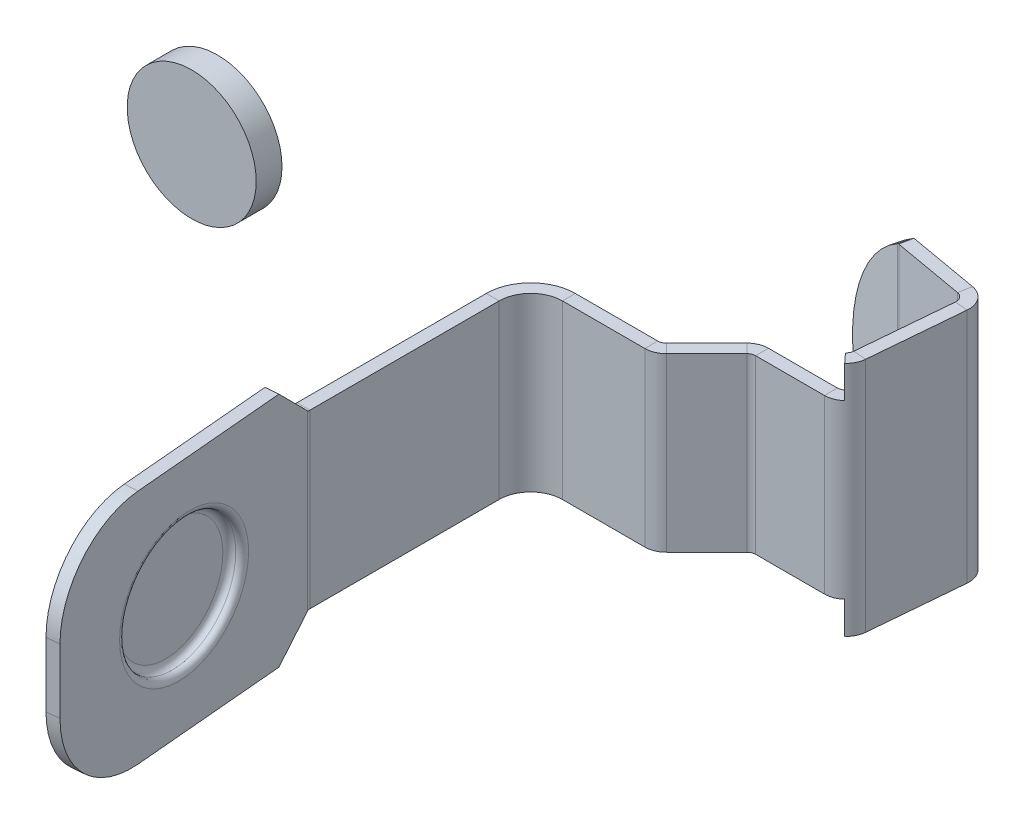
ISO-10303-21;
HEADER;
FILE_DESCRIPTION(('STEP AP214'),'2;1');
FILE_NAME('part.step','',(''),(''),'','','');
FILE_SCHEMA(('AUTOMOTIVE_DESIGN { 1 0 10303 214 1 1 1 1 }'));
ENDSEC;
DATA;
#1=APPLICATION_CONTEXT('core data for automotive mechanical design processes');
#2=APPLICATION_PROTOCOL_DEFINITION('international standard','automotive_design',2000,#1);
#3=PRODUCT_CONTEXT('',#1,'mechanical');
#4=PRODUCT('Part','Part','',(#3));
#5=PRODUCT_RELATED_PRODUCT_CATEGORY('part','',(#4));
#6=PRODUCT_DEFINITION_FORMATION('','',#4);
#7=PRODUCT_DEFINITION_CONTEXT('part definition',#1,'design');
#8=PRODUCT_DEFINITION('design','',#6,#7);
#9=PRODUCT_DEFINITION_SHAPE('','',#8);
#10=(LENGTH_UNIT() NAMED_UNIT(*) SI_UNIT(.MILLI.,.METRE.));
#11=(NAMED_UNIT(*) PLANE_ANGLE_UNIT() SI_UNIT($,.RADIAN.));
#12=(NAMED_UNIT(*) SI_UNIT($,.STERADIAN.) SOLID_ANGLE_UNIT());
#13=UNCERTAINTY_MEASURE_WITH_UNIT(LENGTH_MEASURE(1.E-05),#10,'distance_accuracy_value','');
#14=(GEOMETRIC_REPRESENTATION_CONTEXT(3) GLOBAL_UNCERTAINTY_ASSIGNED_CONTEXT((#13)) GLOBAL_UNIT_ASSIGNED_CONTEXT((#10,
#11,#12)) REPRESENTATION_CONTEXT('',''));
#15=CARTESIAN_POINT('',(0.,0.,0.));
#16=DIRECTION('',(0.,0.,1.));
#17=DIRECTION('',(1.,0.,0.));
#18=AXIS2_PLACEMENT_3D('',#15,#16,#17);
#19=CARTESIAN_POINT('',(4.83144284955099,0.,9.50826119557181));
#20=DIRECTION('',(0.996194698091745,0.,-0.0871557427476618));
#21=DIRECTION('',(-0.0871557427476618,0.,-0.996194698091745));
#22=AXIS2_PLACEMENT_3D('',#19,#20,#21);
#23=PLANE('',#22);
#24=CARTESIAN_POINT('',(4.83144284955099,0.,9.50826119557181));
#25=DIRECTION('',(0.996194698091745,0.,-0.0871557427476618));
#26=DIRECTION('',(-0.0871557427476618,0.,-0.996194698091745));
#27=AXIS2_PLACEMENT_3D('',#24,#25,#26);
#28=CIRCLE('',#27,1.35);
#29=CARTESIAN_POINT('',(4.71378259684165,0.,8.16339835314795));
#30=VERTEX_POINT('',#29);
#31=EDGE_CURVE('E883',#30,#30,#28,.T.);
#32=ORIENTED_EDGE('',*,*,#31,.T.);
#33=EDGE_LOOP('',(#32));
#34=FACE_BOUND('',#33,.T.);
#35=ADVANCED_FACE('F39',(#34),#23,.T.);
#36=CARTESIAN_POINT('',(4.53258444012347,0.,9.53440791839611));
#37=DIRECTION('',(0.996194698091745,0.,-0.0871557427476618));
#38=DIRECTION('',(-0.0871557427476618,0.,-0.996194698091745));
#39=AXIS2_PLACEMENT_3D('',#36,#37,#38);
#40=PLANE('',#39);
#41=CARTESIAN_POINT('',(4.53258444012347,0.,9.53440791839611));
#42=DIRECTION('',(0.996194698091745,0.,-0.0871557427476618));
#43=DIRECTION('',(-0.0871557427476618,0.,-0.996194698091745));
#44=AXIS2_PLACEMENT_3D('',#41,#42,#43);
#45=CIRCLE('',#44,1.65);
#46=CARTESIAN_POINT('',(4.38877746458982,0.,7.89068666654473));
#47=VERTEX_POINT('',#46);
#48=EDGE_CURVE('E881',#47,#47,#45,.F.);
#49=ORIENTED_EDGE('',*,*,#48,.T.);
#50=EDGE_LOOP('',(#49));
#51=FACE_BOUND('',#50,.T.);
#52=ADVANCED_FACE('F891',(#51),#40,.F.);
#53=CARTESIAN_POINT('',(4.98087205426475,0.,9.49518783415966));
#54=DIRECTION('',(0.996194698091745,0.,-0.0871557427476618));
#55=DIRECTION('',(-0.0871557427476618,0.,-0.996194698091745));
#56=AXIS2_PLACEMENT_3D('',#53,#54,#55);
#57=TOROIDAL_SURFACE('',#56,1.35,0.15);
#58=CARTESIAN_POINT('',(4.98087205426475,0.,9.49518783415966));
#59=DIRECTION('',(-0.996194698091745,0.,0.0871557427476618));
#60=DIRECTION('',(0.0871557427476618,0.,0.996194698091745));
#61=AXIS2_PLACEMENT_3D('',#58,#59,#60);
#62=CIRCLE('',#61,1.5);
#63=CARTESIAN_POINT('',(4.85013844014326,0.,8.00089578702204));
#64=VERTEX_POINT('',#63);
#65=CARTESIAN_POINT('',(5.11160566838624,0.,10.9894798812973));
#66=VERTEX_POINT('',#65);
#67=EDGE_CURVE('E879',#64,#66,#62,.F.);
#68=ORIENTED_EDGE('',*,*,#67,.T.);
#69=CARTESIAN_POINT('',(4.98087205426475,0.,9.49518783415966));
#70=DIRECTION('',(-0.996194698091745,0.,0.0871557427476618));
#71=DIRECTION('',(0.0871557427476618,0.,0.996194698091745));
#72=AXIS2_PLACEMENT_3D('',#69,#70,#71);
#73=CIRCLE('',#72,1.5);
#74=EDGE_CURVE('E148',#66,#64,#73,.F.);
#75=ORIENTED_EDGE('',*,*,#74,.T.);
#76=EDGE_LOOP('',(#68,#75));
#77=FACE_BOUND('',#76,.T.);
#78=ORIENTED_EDGE('',*,*,#31,.F.);
#79=EDGE_LOOP('',(#78));
#80=FACE_BOUND('',#79,.T.);
#81=ADVANCED_FACE('F888',(#77,#80),#57,.F.);
#82=CARTESIAN_POINT('',(4.68201364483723,0.,9.52133455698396));
#83=DIRECTION('',(0.996194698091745,0.,-0.0871557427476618));
#84=DIRECTION('',(-0.0871557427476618,0.,-0.996194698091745));
#85=AXIS2_PLACEMENT_3D('',#82,#83,#84);
#86=TOROIDAL_SURFACE('',#85,1.65,0.15);
#87=ORIENTED_EDGE('',*,*,#48,.F.);
#88=EDGE_LOOP('',(#87));
#89=FACE_BOUND('',#88,.T.);
#90=CARTESIAN_POINT('',(4.68201364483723,0.,9.52133455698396));
#91=DIRECTION('',(0.996194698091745,0.,-0.0871557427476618));
#92=DIRECTION('',(-0.0871557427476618,0.,-0.996194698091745));
#93=AXIS2_PLACEMENT_3D('',#90,#91,#92);
#94=CIRCLE('',#93,1.8);
#95=CARTESIAN_POINT('',(4.52513330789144,0.,7.72818410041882));
#96=VERTEX_POINT('',#95);
#97=CARTESIAN_POINT('',(4.83889398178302,0.,11.3144850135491));
#98=VERTEX_POINT('',#97);
#99=EDGE_CURVE('E142',#96,#98,#94,.T.);
#100=ORIENTED_EDGE('',*,*,#99,.F.);
#101=CARTESIAN_POINT('',(4.68201364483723,0.,9.52133455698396));
#102=DIRECTION('',(0.996194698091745,0.,-0.0871557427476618));
#103=DIRECTION('',(-0.0871557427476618,0.,-0.996194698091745));
#104=AXIS2_PLACEMENT_3D('',#101,#102,#103);
#105=CIRCLE('',#104,1.8);
#106=EDGE_CURVE('E844',#98,#96,#105,.T.);
#107=ORIENTED_EDGE('',*,*,#106,.F.);
#108=EDGE_LOOP('',(#100,#107));
#109=FACE_BOUND('',#108,.T.);
#110=ADVANCED_FACE('F890',(#89,#109),#86,.T.);
#111=CARTESIAN_POINT('',(4.98087205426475,0.,9.49518783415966));
#112=DIRECTION('',(-0.996194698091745,0.,0.0871557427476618));
#113=DIRECTION('',(0.0871557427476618,0.,0.996194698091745));
#114=AXIS2_PLACEMENT_3D('',#111,#112,#113);
#115=TOROIDAL_SURFACE('',#114,1.65,0.15);
#116=CARTESIAN_POINT('',(5.13030125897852,0.,9.48211447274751));
#117=DIRECTION('',(-0.996194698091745,0.,0.0871557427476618));
#118=DIRECTION('',(0.0871557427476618,0.,0.996194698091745));
#119=AXIS2_PLACEMENT_3D('',#116,#117,#118);
#120=CIRCLE('',#119,1.65);
#121=CARTESIAN_POINT('',(5.27410823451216,0.,11.1258357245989));
#122=VERTEX_POINT('',#121);
#123=EDGE_CURVE('E806',#122,#122,#120,.T.);
#124=ORIENTED_EDGE('',*,*,#123,.F.);
#125=EDGE_LOOP('',(#124));
#126=FACE_BOUND('',#125,.T.);
#127=ORIENTED_EDGE('',*,*,#74,.F.);
#128=ORIENTED_EDGE('',*,*,#67,.F.);
#129=EDGE_LOOP('',(#127,#128));
#130=FACE_BOUND('',#129,.T.);
#131=ADVANCED_FACE('F897',(#126,#130),#115,.T.);
#132=CARTESIAN_POINT('',(4.93385084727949,2.74999999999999,10.6787899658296));
#133=DIRECTION('',(0.,1.,0.));
#134=DIRECTION('',(0.0871557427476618,0.,0.996194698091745));
#135=AXIS2_PLACEMENT_3D('',#132,#133,#134);
#136=PLANE('',#135);
#137=DIRECTION('',(0.0871557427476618,0.,0.996194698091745));
#138=VECTOR('',#137,1.);
#139=CARTESIAN_POINT('',(5.23270925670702,2.74999999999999,10.6526432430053));
#140=LINE('',#139,#138);
#141=CARTESIAN_POINT('',(4.91894858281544,2.74999999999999,7.06634232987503));
#142=VERTEX_POINT('',#141);
#143=CARTESIAN_POINT('',(5.23270925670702,2.74999999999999,10.6526432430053));
#144=VERTEX_POINT('',#143);
#145=EDGE_CURVE('E830',#142,#144,#140,.T.);
#146=ORIENTED_EDGE('',*,*,#145,.F.);
#147=DIRECTION('',(0.996194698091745,0.,-0.0871557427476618));
#148=VECTOR('',#147,1.);
#149=CARTESIAN_POINT('',(4.62009017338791,2.74999999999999,7.09248905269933));
#150=LINE('',#149,#148);
#151=CARTESIAN_POINT('',(4.62009017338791,2.74999999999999,7.09248905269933));
#152=VERTEX_POINT('',#151);
#153=EDGE_CURVE('E846',#152,#142,#150,.T.);
#154=ORIENTED_EDGE('',*,*,#153,.F.);
#155=DIRECTION('',(0.0871557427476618,0.,0.996194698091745));
#156=VECTOR('',#155,1.);
#157=CARTESIAN_POINT('',(4.93385084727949,2.74999999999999,10.6787899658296));
#158=LINE('',#157,#156);
#159=CARTESIAN_POINT('',(4.93385084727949,2.74999999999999,10.6787899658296));
#160=VERTEX_POINT('',#159);
#161=EDGE_CURVE('E875',#152,#160,#158,.T.);
#162=ORIENTED_EDGE('',*,*,#161,.T.);
#163=DIRECTION('',(0.996194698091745,0.,-0.0871557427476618));
#164=VECTOR('',#163,1.);
#165=CARTESIAN_POINT('',(4.93385084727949,2.74999999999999,10.6787899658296));
#166=LINE('',#165,#164);
#167=EDGE_CURVE('E873',#160,#144,#166,.T.);
#168=ORIENTED_EDGE('',*,*,#167,.T.);
#169=EDGE_LOOP('',(#146,#154,#162,#168));
#170=FACE_BOUND('',#169,.T.);
#171=ADVANCED_FACE('F1672',(#170),#136,.T.);
#172=CARTESIAN_POINT('',(4.93385084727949,0.749999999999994,10.6787899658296));
#173=DIRECTION('',(0.996194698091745,0.,-0.0871557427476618));
#174=DIRECTION('',(-0.0871557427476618,0.,-0.996194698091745));
#175=AXIS2_PLACEMENT_3D('',#172,#173,#174);
#176=CYLINDRICAL_SURFACE('',#175,2.);
#177=CARTESIAN_POINT('',(5.23270925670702,0.749999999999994,10.6526432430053));
#178=DIRECTION('',(0.996194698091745,0.,-0.0871557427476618));
#179=DIRECTION('',(0.0871557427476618,0.,0.996194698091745));
#180=AXIS2_PLACEMENT_3D('',#177,#178,#179);
#181=CIRCLE('',#180,2.);
#182=CARTESIAN_POINT('',(5.40702074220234,0.749999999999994,12.6450326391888));
#183=VERTEX_POINT('',#182);
#184=EDGE_CURVE('E827',#144,#183,#181,.T.);
#185=ORIENTED_EDGE('',*,*,#184,.F.);
#186=ORIENTED_EDGE('',*,*,#167,.F.);
#187=CARTESIAN_POINT('',(4.93385084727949,0.749999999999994,10.6787899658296));
#188=DIRECTION('',(0.996194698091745,0.,-0.0871557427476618));
#189=DIRECTION('',(0.0871557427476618,0.,0.996194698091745));
#190=AXIS2_PLACEMENT_3D('',#187,#188,#189);
#191=CIRCLE('',#190,2.);
#192=CARTESIAN_POINT('',(5.10816233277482,0.749999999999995,12.6711793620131));
#193=VERTEX_POINT('',#192);
#194=EDGE_CURVE('E870',#160,#193,#191,.T.);
#195=ORIENTED_EDGE('',*,*,#194,.T.);
#196=DIRECTION('',(0.996194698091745,0.,-0.0871557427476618));
#197=VECTOR('',#196,1.);
#198=CARTESIAN_POINT('',(5.10816233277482,0.749999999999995,12.6711793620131));
#199=LINE('',#198,#197);
#200=EDGE_CURVE('E868',#193,#183,#199,.T.);
#201=ORIENTED_EDGE('',*,*,#200,.T.);
#202=EDGE_LOOP('',(#185,#186,#195,#201));
#203=FACE_BOUND('',#202,.T.);
#204=ADVANCED_FACE('F1663',(#203),#176,.T.);
#205=CARTESIAN_POINT('',(5.10816233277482,0.749999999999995,12.6711793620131));
#206=DIRECTION('',(0.0871557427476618,0.,0.996194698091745));
#207=DIRECTION('',(0.996194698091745,0.,-0.0871557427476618));
#208=AXIS2_PLACEMENT_3D('',#205,#206,#207);
#209=PLANE('',#208);
#210=DIRECTION('',(0.,-1.,0.));
#211=VECTOR('',#210,1.);
#212=CARTESIAN_POINT('',(5.40702074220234,0.749999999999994,12.6450326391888));
#213=LINE('',#212,#211);
#214=CARTESIAN_POINT('',(5.40702074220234,-0.749999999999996,12.6450326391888));
#215=VERTEX_POINT('',#214);
#216=EDGE_CURVE('E824',#183,#215,#213,.T.);
#217=ORIENTED_EDGE('',*,*,#216,.F.);
#218=ORIENTED_EDGE('',*,*,#200,.F.);
#219=DIRECTION('',(0.,-1.,0.));
#220=VECTOR('',#219,1.);
#221=CARTESIAN_POINT('',(5.10816233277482,0.749999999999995,12.6711793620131));
#222=LINE('',#221,#220);
#223=CARTESIAN_POINT('',(5.10816233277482,-0.749999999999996,12.6711793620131));
#224=VERTEX_POINT('',#223);
#225=EDGE_CURVE('E865',#193,#224,#222,.T.);
#226=ORIENTED_EDGE('',*,*,#225,.T.);
#227=DIRECTION('',(0.996194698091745,0.,-0.0871557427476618));
#228=VECTOR('',#227,1.);
#229=CARTESIAN_POINT('',(5.10816233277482,-0.749999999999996,12.6711793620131));
#230=LINE('',#229,#228);
#231=EDGE_CURVE('E863',#224,#215,#230,.T.);
#232=ORIENTED_EDGE('',*,*,#231,.T.);
#233=EDGE_LOOP('',(#217,#218,#226,#232));
#234=FACE_BOUND('',#233,.T.);
#235=ADVANCED_FACE('F1655',(#234),#209,.T.);
#236=CARTESIAN_POINT('',(4.93385084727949,-0.749999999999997,10.6787899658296));
#237=DIRECTION('',(0.996194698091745,0.,-0.0871557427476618));
#238=DIRECTION('',(-0.0871557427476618,0.,-0.996194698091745));
#239=AXIS2_PLACEMENT_3D('',#236,#237,#238);
#240=CYLINDRICAL_SURFACE('',#239,2.);
#241=CARTESIAN_POINT('',(5.23270925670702,-0.749999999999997,10.6526432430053));
#242=DIRECTION('',(0.996194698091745,0.,-0.0871557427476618));
#243=DIRECTION('',(0.0871557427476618,0.,0.996194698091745));
#244=AXIS2_PLACEMENT_3D('',#241,#242,#243);
#245=CIRCLE('',#244,2.);
#246=CARTESIAN_POINT('',(5.23270925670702,-2.75,10.6526432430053));
#247=VERTEX_POINT('',#246);
#248=EDGE_CURVE('E821',#215,#247,#245,.T.);
#249=ORIENTED_EDGE('',*,*,#248,.F.);
#250=ORIENTED_EDGE('',*,*,#231,.F.);
#251=CARTESIAN_POINT('',(4.93385084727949,-0.749999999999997,10.6787899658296));
#252=DIRECTION('',(0.996194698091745,0.,-0.0871557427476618));
#253=DIRECTION('',(0.0871557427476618,0.,0.996194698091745));
#254=AXIS2_PLACEMENT_3D('',#251,#252,#253);
#255=CIRCLE('',#254,2.);
#256=CARTESIAN_POINT('',(4.9338508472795,-2.75,10.6787899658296));
#257=VERTEX_POINT('',#256);
#258=EDGE_CURVE('E860',#224,#257,#255,.T.);
#259=ORIENTED_EDGE('',*,*,#258,.T.);
#260=DIRECTION('',(0.996194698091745,0.,-0.0871557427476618));
#261=VECTOR('',#260,1.);
#262=CARTESIAN_POINT('',(4.9338508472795,-2.75,10.6787899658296));
#263=LINE('',#262,#261);
#264=EDGE_CURVE('E858',#257,#247,#263,.T.);
#265=ORIENTED_EDGE('',*,*,#264,.T.);
#266=EDGE_LOOP('',(#249,#250,#259,#265));
#267=FACE_BOUND('',#266,.T.);
#268=ADVANCED_FACE('F1647',(#267),#240,.T.);
#269=CARTESIAN_POINT('',(4.62009017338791,-2.75,7.09248905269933));
#270=DIRECTION('',(0.,-1.,0.));
#271=DIRECTION('',(-0.0871557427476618,0.,-0.996194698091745));
#272=AXIS2_PLACEMENT_3D('',#269,#270,#271);
#273=PLANE('',#272);
#274=DIRECTION('',(-0.0871557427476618,0.,-0.996194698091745));
#275=VECTOR('',#274,1.);
#276=CARTESIAN_POINT('',(4.91894858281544,-2.75,7.06634232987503));
#277=LINE('',#276,#275);
#278=CARTESIAN_POINT('',(4.91894858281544,-2.75,7.06634232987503));
#279=VERTEX_POINT('',#278);
#280=EDGE_CURVE('E813',#247,#279,#277,.T.);
#281=ORIENTED_EDGE('',*,*,#280,.F.);
#282=ORIENTED_EDGE('',*,*,#264,.F.);
#283=DIRECTION('',(-0.0871557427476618,0.,-0.996194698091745));
#284=VECTOR('',#283,1.);
#285=CARTESIAN_POINT('',(4.62009017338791,-2.75,7.09248905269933));
#286=LINE('',#285,#284);
#287=CARTESIAN_POINT('',(4.62009017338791,-2.75,7.09248905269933));
#288=VERTEX_POINT('',#287);
#289=EDGE_CURVE('E855',#257,#288,#286,.T.);
#290=ORIENTED_EDGE('',*,*,#289,.T.);
#291=DIRECTION('',(0.996194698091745,0.,-0.0871557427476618));
#292=VECTOR('',#291,1.);
#293=CARTESIAN_POINT('',(4.62009017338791,-2.75,7.09248905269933));
#294=LINE('',#293,#292);
#295=EDGE_CURVE('E853',#288,#279,#294,.T.);
#296=ORIENTED_EDGE('',*,*,#295,.T.);
#297=EDGE_LOOP('',(#281,#282,#290,#296));
#298=FACE_BOUND('',#297,.T.);
#299=ADVANCED_FACE('F729',(#298),#273,.T.);
#300=CARTESIAN_POINT('',(4.62009017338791,2.74999999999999,7.09248905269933));
#301=DIRECTION('',(-0.0616284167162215,0.707106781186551,-0.704416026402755));
#302=DIRECTION('',(0.0616284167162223,0.707106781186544,0.704416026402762));
#303=AXIS2_PLACEMENT_3D('',#300,#301,#302);
#304=PLANE('',#303);
#305=DIRECTION('',(0.0616284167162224,0.707106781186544,0.704416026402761));
#306=VECTOR('',#305,1.);
#307=CARTESIAN_POINT('',(4.91894858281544,2.74999999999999,7.06634232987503));
#308=LINE('',#307,#306);
#309=CARTESIAN_POINT('',(4.8554568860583,2.0215144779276,6.34062891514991));
#310=VERTEX_POINT('',#309);
#311=EDGE_CURVE('E833',#310,#142,#308,.T.);
#312=ORIENTED_EDGE('',*,*,#311,.F.);
#313=CARTESIAN_POINT('',(4.55659847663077,2.0215144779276,6.36677563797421));
#314=CARTESIAN_POINT('',(4.8554568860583,2.0215144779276,6.34062891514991));
#315=B_SPLINE_CURVE_WITH_KNOTS('',1,(#313,#314),.UNSPECIFIED.,.F.,.F.,(2,2),(0.,1.),.UNSPECIFIED.);
#316=CARTESIAN_POINT('',(4.55659847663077,2.0215144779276,6.36677563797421));
#317=VERTEX_POINT('',#316);
#318=EDGE_CURVE('E710',#310,#317,#315,.F.);
#319=ORIENTED_EDGE('',*,*,#318,.T.);
#320=DIRECTION('',(0.0616284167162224,0.707106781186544,0.704416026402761));
#321=VECTOR('',#320,1.);
#322=CARTESIAN_POINT('',(4.62009017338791,2.74999999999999,7.09248905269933));
#323=LINE('',#322,#321);
#324=EDGE_CURVE('E849',#317,#152,#323,.T.);
#325=ORIENTED_EDGE('',*,*,#324,.T.);
#326=ORIENTED_EDGE('',*,*,#153,.T.);
#327=EDGE_LOOP('',(#312,#319,#325,#326));
#328=FACE_BOUND('',#327,.T.);
#329=ADVANCED_FACE('F718',(#328),#304,.T.);
#330=CARTESIAN_POINT('',(4.68201364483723,0.,9.52133455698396));
#331=DIRECTION('',(-0.996194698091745,0.,0.0871557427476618));
#332=DIRECTION('',(0.0871557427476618,0.,0.996194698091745));
#333=AXIS2_PLACEMENT_3D('',#330,#331,#332);
#334=TOROIDAL_SURFACE('',#333,1.95,0.15);
#335=CARTESIAN_POINT('',(4.83144284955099,0.,9.50826119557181));
#336=DIRECTION('',(-0.996194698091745,0.,0.0871557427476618));
#337=DIRECTION('',(0.0871557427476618,0.,0.996194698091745));
#338=AXIS2_PLACEMENT_3D('',#335,#336,#337);
#339=CIRCLE('',#338,1.95);
#340=CARTESIAN_POINT('',(5.00139654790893,0.,11.4508408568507));
#341=VERTEX_POINT('',#340);
#342=EDGE_CURVE('E802',#341,#341,#339,.F.);
#343=ORIENTED_EDGE('',*,*,#342,.F.);
#344=EDGE_LOOP('',(#343));
#345=FACE_BOUND('',#344,.T.);
#346=ORIENTED_EDGE('',*,*,#106,.T.);
#347=ORIENTED_EDGE('',*,*,#99,.T.);
#348=EDGE_LOOP('',(#346,#347));
#349=FACE_BOUND('',#348,.T.);
#350=ADVANCED_FACE('F728',(#345,#349),#334,.F.);
#351=CARTESIAN_POINT('',(4.62009017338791,-2.75,7.09248905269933));
#352=DIRECTION('',(-0.0616284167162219,-0.70710678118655,-0.704416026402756));
#353=DIRECTION('',(-0.0616284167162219,0.707106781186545,-0.704416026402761));
#354=AXIS2_PLACEMENT_3D('',#351,#352,#353);
#355=PLANE('',#354);
#356=DIRECTION('',(-0.061628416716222,0.707106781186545,-0.70441602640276));
#357=VECTOR('',#356,1.);
#358=CARTESIAN_POINT('',(4.62009017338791,-2.75,7.09248905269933));
#359=LINE('',#358,#357);
#360=CARTESIAN_POINT('',(4.55659847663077,-2.0215144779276,6.36677563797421));
#361=VERTEX_POINT('',#360);
#362=EDGE_CURVE('E838',#288,#361,#359,.T.);
#363=ORIENTED_EDGE('',*,*,#362,.T.);
#364=CARTESIAN_POINT('',(4.8554568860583,-2.0215144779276,6.34062891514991));
#365=CARTESIAN_POINT('',(4.55659847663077,-2.0215144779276,6.36677563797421));
#366=B_SPLINE_CURVE_WITH_KNOTS('',1,(#364,#365),.UNSPECIFIED.,.F.,.F.,(2,2),(0.,1.),.UNSPECIFIED.);
#367=CARTESIAN_POINT('',(4.8554568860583,-2.0215144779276,6.34062891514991));
#368=VERTEX_POINT('',#367);
#369=EDGE_CURVE('E835',#361,#368,#366,.F.);
#370=ORIENTED_EDGE('',*,*,#369,.T.);
#371=DIRECTION('',(-0.061628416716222,0.707106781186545,-0.70441602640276));
#372=VECTOR('',#371,1.);
#373=CARTESIAN_POINT('',(4.91894858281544,-2.75,7.06634232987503));
#374=LINE('',#373,#372);
#375=EDGE_CURVE('E808',#279,#368,#374,.T.);
#376=ORIENTED_EDGE('',*,*,#375,.F.);
#377=ORIENTED_EDGE('',*,*,#295,.F.);
#378=EDGE_LOOP('',(#363,#370,#376,#377));
#379=FACE_BOUND('',#378,.T.);
#380=ADVANCED_FACE('F733',(#379),#355,.T.);
#381=CARTESIAN_POINT('',(3.60035482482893,0.,-8.00525329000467));
#382=DIRECTION('',(-0.996194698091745,0.,0.0871557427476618));
#383=DIRECTION('',(0.0871557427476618,0.,0.996194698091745));
#384=AXIS2_PLACEMENT_3D('',#381,#382,#383);
#385=PLANE('',#384);
#386=DIRECTION('',(0.,-1.,0.));
#387=VECTOR('',#386,1.);
#388=CARTESIAN_POINT('',(4.8554568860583,0.,6.34062891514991));
#389=LINE('',#388,#387);
#390=EDGE_CURVE('E1743',#310,#368,#389,.T.);
#391=ORIENTED_EDGE('',*,*,#390,.F.);
#392=ORIENTED_EDGE('',*,*,#311,.T.);
#393=ORIENTED_EDGE('',*,*,#145,.T.);
#394=ORIENTED_EDGE('',*,*,#184,.T.);
#395=ORIENTED_EDGE('',*,*,#216,.T.);
#396=ORIENTED_EDGE('',*,*,#248,.T.);
#397=ORIENTED_EDGE('',*,*,#280,.T.);
#398=ORIENTED_EDGE('',*,*,#375,.T.);
#399=EDGE_LOOP('',(#391,#392,#393,#394,#395,#396,#397,#398));
#400=FACE_BOUND('',#399,.T.);
#401=ORIENTED_EDGE('',*,*,#123,.T.);
#402=EDGE_LOOP('',(#401));
#403=FACE_BOUND('',#402,.T.);
#404=ADVANCED_FACE('F738',(#400,#403),#385,.F.);
#405=CARTESIAN_POINT('',(4.5547103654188,2.,6.34169279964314));
#406=CARTESIAN_POINT('',(4.55523826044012,2.00717149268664,6.35006097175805));
#407=CARTESIAN_POINT('',(4.55586769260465,2.01434298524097,6.35842273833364));
#408=CARTESIAN_POINT('',(4.55659847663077,2.0215144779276,6.36677563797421));
#409=CARTESIAN_POINT('',(4.85411520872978,2.,6.32280524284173));
#410=CARTESIAN_POINT('',(4.85449032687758,2.00717149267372,6.3287516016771));
#411=CARTESIAN_POINT('',(4.85493759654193,2.01434298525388,6.33469340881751));
#412=CARTESIAN_POINT('',(4.8554568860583,2.0215144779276,6.34062891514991));
#413=B_SPLINE_SURFACE_WITH_KNOTS('',1,3,((#405,#406,#407,#408),(#409,#410,#411,#412)),
.UNSPECIFIED.,.F.,.F.,.F.,(2,2),(4,4),(0.,1.),(0.,1.),.UNSPECIFIED.);
#414=CARTESIAN_POINT('',(4.8554568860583,2.0215144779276,6.34062891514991));
#415=CARTESIAN_POINT('',(4.85493759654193,2.01434298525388,6.33469340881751));
#416=CARTESIAN_POINT('',(4.85449032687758,2.00717149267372,6.3287516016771));
#417=CARTESIAN_POINT('',(4.85411520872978,2.,6.32280524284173));
#418=B_SPLINE_CURVE_WITH_KNOTS('',3,(#414,#415,#416,#417),.UNSPECIFIED.,.F.,.F.,(4,4),(0.,1.),.UNSPECIFIED.);
#419=CARTESIAN_POINT('',(4.85411520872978,2.,6.32280524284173));
#420=VERTEX_POINT('',#419);
#421=EDGE_CURVE('E1812',#420,#310,#418,.F.);
#422=CARTESIAN_POINT('',(4.85411520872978,2.,6.32280524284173));
#423=CARTESIAN_POINT('',(4.5547103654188,2.,6.34169279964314));
#424=B_SPLINE_CURVE_WITH_KNOTS('',1,(#422,#423),.UNSPECIFIED.,.F.,.F.,(2,2),(0.,1.),.UNSPECIFIED.);
#425=CARTESIAN_POINT('',(4.5547103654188,2.,6.34169279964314));
#426=VERTEX_POINT('',#425);
#427=EDGE_CURVE('E797',#420,#426,#424,.T.);
#428=CARTESIAN_POINT('',(4.5547103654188,2.,6.34169279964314));
#429=CARTESIAN_POINT('',(4.55523826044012,2.00717149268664,6.35006097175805));
#430=CARTESIAN_POINT('',(4.55586769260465,2.01434298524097,6.35842273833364));
#431=CARTESIAN_POINT('',(4.55659847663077,2.0215144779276,6.36677563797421));
#432=B_SPLINE_CURVE_WITH_KNOTS('',3,(#428,#429,#430,#431),.UNSPECIFIED.,.F.,.F.,(4,4),(0.,1.),.UNSPECIFIED.);
#433=EDGE_CURVE('E796',#426,#317,#432,.T.);
#434=ORIENTED_EDGE('',*,*,#318,.F.);
#435=ORIENTED_EDGE('',*,*,#421,.F.);
#436=ORIENTED_EDGE('',*,*,#427,.T.);
#437=ORIENTED_EDGE('',*,*,#433,.T.);
#438=EDGE_LOOP('',(#434,#435,#436,#437));
#439=FACE_BOUND('',#438,.T.);
#440=ADVANCED_FACE('F758',(#439),#413,.F.);
#441=CARTESIAN_POINT('',(3.30149641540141,0.,-7.97910656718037));
#442=DIRECTION('',(-0.996194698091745,0.,0.0871557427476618));
#443=DIRECTION('',(0.0871557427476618,0.,0.996194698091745));
#444=AXIS2_PLACEMENT_3D('',#441,#442,#443);
#445=PLANE('',#444);
#446=ORIENTED_EDGE('',*,*,#342,.T.);
#447=EDGE_LOOP('',(#446));
#448=FACE_BOUND('',#447,.T.);
#449=ORIENTED_EDGE('',*,*,#324,.F.);
#450=DIRECTION('',(0.,-1.,0.));
#451=VECTOR('',#450,1.);
#452=CARTESIAN_POINT('',(4.55659847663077,0.,6.36677563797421));
#453=LINE('',#452,#451);
#454=EDGE_CURVE('E804',#317,#361,#453,.T.);
#455=ORIENTED_EDGE('',*,*,#454,.T.);
#456=ORIENTED_EDGE('',*,*,#362,.F.);
#457=ORIENTED_EDGE('',*,*,#289,.F.);
#458=ORIENTED_EDGE('',*,*,#258,.F.);
#459=ORIENTED_EDGE('',*,*,#225,.F.);
#460=ORIENTED_EDGE('',*,*,#194,.F.);
#461=ORIENTED_EDGE('',*,*,#161,.F.);
#462=EDGE_LOOP('',(#449,#455,#456,#457,#458,#459,#460,#461));
#463=FACE_BOUND('',#462,.T.);
#464=ADVANCED_FACE('F769',(#448,#463),#445,.T.);
#465=CARTESIAN_POINT('',(4.55659847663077,-2.0215144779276,6.36677563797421));
#466=CARTESIAN_POINT('',(4.55586769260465,-2.01434298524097,6.35842273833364));
#467=CARTESIAN_POINT('',(4.55523826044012,-2.00717149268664,6.35006097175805));
#468=CARTESIAN_POINT('',(4.5547103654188,-2.,6.34169279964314));
#469=CARTESIAN_POINT('',(4.8554568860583,-2.0215144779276,6.34062891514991));
#470=CARTESIAN_POINT('',(4.85493759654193,-2.01434298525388,6.33469340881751));
#471=CARTESIAN_POINT('',(4.85449032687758,-2.00717149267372,6.3287516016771));
#472=CARTESIAN_POINT('',(4.85411520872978,-2.,6.32280524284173));
#473=B_SPLINE_SURFACE_WITH_KNOTS('',1,3,((#465,#466,#467,#468),(#469,#470,#471,#472)),
.UNSPECIFIED.,.F.,.F.,.F.,(2,2),(4,4),(0.,1.),(0.,1.),.UNSPECIFIED.);
#474=CARTESIAN_POINT('',(4.85411520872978,-2.,6.32280524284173));
#475=CARTESIAN_POINT('',(4.85449032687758,-2.00717149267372,6.3287516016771));
#476=CARTESIAN_POINT('',(4.85493759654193,-2.01434298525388,6.33469340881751));
#477=CARTESIAN_POINT('',(4.8554568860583,-2.0215144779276,6.34062891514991));
#478=B_SPLINE_CURVE_WITH_KNOTS('',3,(#474,#475,#476,#477),.UNSPECIFIED.,.F.,.F.,(4,4),(0.,1.),.UNSPECIFIED.);
#479=CARTESIAN_POINT('',(4.85411520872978,-2.,6.32280524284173));
#480=VERTEX_POINT('',#479);
#481=EDGE_CURVE('E1763',#368,#480,#478,.F.);
#482=CARTESIAN_POINT('',(4.55659847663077,-2.0215144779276,6.36677563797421));
#483=CARTESIAN_POINT('',(4.55586769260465,-2.01434298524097,6.35842273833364));
#484=CARTESIAN_POINT('',(4.55523826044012,-2.00717149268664,6.35006097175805));
#485=CARTESIAN_POINT('',(4.5547103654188,-2.,6.34169279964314));
#486=B_SPLINE_CURVE_WITH_KNOTS('',3,(#482,#483,#484,#485),.UNSPECIFIED.,.F.,.F.,(4,4),(0.,1.),.UNSPECIFIED.);
#487=CARTESIAN_POINT('',(4.5547103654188,-2.,6.34169279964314));
#488=VERTEX_POINT('',#487);
#489=EDGE_CURVE('E1759',#361,#488,#486,.T.);
#490=CARTESIAN_POINT('',(4.5547103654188,-2.,6.34169279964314));
#491=CARTESIAN_POINT('',(4.85411520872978,-2.,6.32280524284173));
#492=B_SPLINE_CURVE_WITH_KNOTS('',1,(#490,#491),.UNSPECIFIED.,.F.,.F.,(2,2),(0.,1.),.UNSPECIFIED.);
#493=EDGE_CURVE('E1836',#480,#488,#492,.F.);
#494=ORIENTED_EDGE('',*,*,#481,.F.);
#495=ORIENTED_EDGE('',*,*,#369,.F.);
#496=ORIENTED_EDGE('',*,*,#489,.T.);
#497=ORIENTED_EDGE('',*,*,#493,.F.);
#498=EDGE_LOOP('',(#494,#495,#496,#497));
#499=FACE_BOUND('',#498,.T.);
#500=ADVANCED_FACE('F1597',(#499),#473,.F.);
#501=CARTESIAN_POINT('',(5.58925390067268,2.,6.27642999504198));
#502=DIRECTION('',(0.,-1.,0.));
#503=DIRECTION('',(-1.,0.,0.));
#504=AXIS2_PLACEMENT_3D('',#501,#502,#503);
#505=PLANE('',#504);
#506=ORIENTED_EDGE('',*,*,#427,.F.);
#507=CARTESIAN_POINT('',(5.58925390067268,2.,6.27642999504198));
#508=DIRECTION('',(0.,-1.,0.));
#509=DIRECTION('',(-1.,0.,0.));
#510=AXIS2_PLACEMENT_3D('',#507,#508,#509);
#511=CIRCLE('',#510,0.7366);
#512=CARTESIAN_POINT('',(4.85265390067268,2.,6.27642999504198));
#513=VERTEX_POINT('',#512);
#514=EDGE_CURVE('E1894',#513,#420,#511,.F.);
#515=ORIENTED_EDGE('',*,*,#514,.F.);
#516=DIRECTION('',(-1.,0.,0.));
#517=VECTOR('',#516,1.);
#518=CARTESIAN_POINT('',(4.55265390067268,2.,6.27642999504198));
#519=LINE('',#518,#517);
#520=CARTESIAN_POINT('',(4.55265390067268,2.,6.27642999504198));
#521=VERTEX_POINT('',#520);
#522=EDGE_CURVE('E1905',#513,#521,#519,.T.);
#523=ORIENTED_EDGE('',*,*,#522,.T.);
#524=CARTESIAN_POINT('',(5.58925390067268,2.,6.27642999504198));
#525=DIRECTION('',(0.,-1.,0.));
#526=DIRECTION('',(-1.,0.,0.));
#527=AXIS2_PLACEMENT_3D('',#524,#525,#526);
#528=CIRCLE('',#527,1.0366);
#529=EDGE_CURVE('E1901',#521,#426,#528,.F.);
#530=ORIENTED_EDGE('',*,*,#529,.T.);
#531=EDGE_LOOP('',(#506,#515,#523,#530));
#532=FACE_BOUND('',#531,.T.);
#533=ADVANCED_FACE('F1588',(#532),#505,.F.);
#534=CARTESIAN_POINT('',(5.58925390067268,21.3220514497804,6.27642999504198));
#535=DIRECTION('',(0.,-1.,0.));
#536=DIRECTION('',(-1.,0.,0.));
#537=AXIS2_PLACEMENT_3D('',#534,#535,#536);
#538=CYLINDRICAL_SURFACE('',#537,0.7366);
#539=CARTESIAN_POINT('',(5.58925390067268,-2.,6.27642999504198));
#540=DIRECTION('',(0.,-1.,0.));
#541=DIRECTION('',(-1.,0.,0.));
#542=AXIS2_PLACEMENT_3D('',#539,#540,#541);
#543=CIRCLE('',#542,0.7366);
#544=CARTESIAN_POINT('',(4.85265390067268,-2.,6.27642999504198));
#545=VERTEX_POINT('',#544);
#546=EDGE_CURVE('E1896',#480,#545,#543,.T.);
#547=ORIENTED_EDGE('',*,*,#546,.T.);
#548=DIRECTION('',(0.,-1.,0.));
#549=VECTOR('',#548,1.);
#550=CARTESIAN_POINT('',(4.85265390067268,0.,6.27642999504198));
#551=LINE('',#550,#549);
#552=EDGE_CURVE('E1868',#513,#545,#551,.T.);
#553=ORIENTED_EDGE('',*,*,#552,.F.);
#554=ORIENTED_EDGE('',*,*,#514,.T.);
#555=ORIENTED_EDGE('',*,*,#421,.T.);
#556=ORIENTED_EDGE('',*,*,#390,.T.);
#557=ORIENTED_EDGE('',*,*,#481,.T.);
#558=EDGE_LOOP('',(#547,#553,#554,#555,#556,#557));
#559=FACE_BOUND('',#558,.T.);
#560=ADVANCED_FACE('F1579',(#559),#538,.F.);
#561=CARTESIAN_POINT('',(5.58925390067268,-2.,6.27642999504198));
#562=DIRECTION('',(0.,1.,0.));
#563=DIRECTION('',(1.,0.,0.));
#564=AXIS2_PLACEMENT_3D('',#561,#562,#563);
#565=PLANE('',#564);
#566=DIRECTION('',(1.,0.,0.));
#567=VECTOR('',#566,1.);
#568=CARTESIAN_POINT('',(4.55265390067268,-2.,6.27642999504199));
#569=LINE('',#568,#567);
#570=CARTESIAN_POINT('',(4.55265390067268,-2.,6.27642999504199));
#571=VERTEX_POINT('',#570);
#572=EDGE_CURVE('E1888',#571,#545,#569,.T.);
#573=ORIENTED_EDGE('',*,*,#572,.T.);
#574=ORIENTED_EDGE('',*,*,#546,.F.);
#575=ORIENTED_EDGE('',*,*,#493,.T.);
#576=CARTESIAN_POINT('',(5.58925390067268,-2.,6.27642999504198));
#577=DIRECTION('',(0.,-1.,0.));
#578=DIRECTION('',(-1.,0.,0.));
#579=AXIS2_PLACEMENT_3D('',#576,#577,#578);
#580=CIRCLE('',#579,1.0366);
#581=EDGE_CURVE('E1884',#488,#571,#580,.T.);
#582=ORIENTED_EDGE('',*,*,#581,.T.);
#583=EDGE_LOOP('',(#573,#574,#575,#582));
#584=FACE_BOUND('',#583,.T.);
#585=ADVANCED_FACE('F1571',(#584),#565,.F.);
#586=CARTESIAN_POINT('',(5.58925390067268,21.3220514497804,6.27642999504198));
#587=DIRECTION('',(0.,-1.,0.));
#588=DIRECTION('',(-1.,0.,0.));
#589=AXIS2_PLACEMENT_3D('',#586,#587,#588);
#590=CYLINDRICAL_SURFACE('',#589,1.0366);
#591=ORIENTED_EDGE('',*,*,#581,.F.);
#592=ORIENTED_EDGE('',*,*,#489,.F.);
#593=ORIENTED_EDGE('',*,*,#454,.F.);
#594=ORIENTED_EDGE('',*,*,#433,.F.);
#595=ORIENTED_EDGE('',*,*,#529,.F.);
#596=DIRECTION('',(0.,-1.,0.));
#597=VECTOR('',#596,1.);
#598=CARTESIAN_POINT('',(4.55265390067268,0.,6.27642999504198));
#599=LINE('',#598,#597);
#600=EDGE_CURVE('E1881',#521,#571,#599,.T.);
#601=ORIENTED_EDGE('',*,*,#600,.T.);
#602=EDGE_LOOP('',(#591,#592,#593,#594,#595,#601));
#603=FACE_BOUND('',#602,.T.);
#604=ADVANCED_FACE('F1562',(#603),#590,.T.);
#605=CARTESIAN_POINT('',(4.55265390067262,0.,-8.04688070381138));
#606=DIRECTION('',(-1.,0.,0.));
#607=DIRECTION('',(0.,0.,1.));
#608=AXIS2_PLACEMENT_3D('',#605,#606,#607);
#609=PLANE('',#608);
#610=DIRECTION('',(0.,0.,1.));
#611=VECTOR('',#610,1.);
#612=CARTESIAN_POINT('',(4.55265390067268,2.,6.33228596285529));
#613=LINE('',#612,#611);
#614=CARTESIAN_POINT('',(4.55265390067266,2.,1.87861997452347));
#615=VERTEX_POINT('',#614);
#616=EDGE_CURVE('E12',#615,#521,#613,.T.);
#617=ORIENTED_EDGE('',*,*,#616,.F.);
#618=DIRECTION('',(0.,-1.,0.));
#619=VECTOR('',#618,1.);
#620=CARTESIAN_POINT('',(4.55265390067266,0.,1.87861997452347));
#621=LINE('',#620,#619);
#622=CARTESIAN_POINT('',(4.55265390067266,-2.,1.87861997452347));
#623=VERTEX_POINT('',#622);
#624=EDGE_CURVE('E1878',#615,#623,#621,.T.);
#625=ORIENTED_EDGE('',*,*,#624,.T.);
#626=DIRECTION('',(0.,0.,-1.));
#627=VECTOR('',#626,1.);
#628=CARTESIAN_POINT('',(4.55265390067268,-2.,6.33228596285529));
#629=LINE('',#628,#627);
#630=EDGE_CURVE('E1875',#571,#623,#629,.T.);
#631=ORIENTED_EDGE('',*,*,#630,.F.);
#632=ORIENTED_EDGE('',*,*,#600,.F.);
#633=EDGE_LOOP('',(#617,#625,#631,#632));
#634=FACE_BOUND('',#633,.T.);
#635=ADVANCED_FACE('F1553',(#634),#609,.T.);
#636=CARTESIAN_POINT('',(4.55265390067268,-2.,6.33228596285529));
#637=DIRECTION('',(0.,-1.,0.));
#638=DIRECTION('',(-1.,0.,0.));
#639=AXIS2_PLACEMENT_3D('',#636,#637,#638);
#640=PLANE('',#639);
#641=ORIENTED_EDGE('',*,*,#630,.T.);
#642=DIRECTION('',(1.,0.,0.));
#643=VECTOR('',#642,1.);
#644=CARTESIAN_POINT('',(4.55265390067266,-2.,1.87861997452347));
#645=LINE('',#644,#643);
#646=CARTESIAN_POINT('',(4.85265390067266,-2.,1.87861997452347));
#647=VERTEX_POINT('',#646);
#648=EDGE_CURVE('E1873',#623,#647,#645,.T.);
#649=ORIENTED_EDGE('',*,*,#648,.T.);
#650=DIRECTION('',(0.,0.,-1.));
#651=VECTOR('',#650,1.);
#652=CARTESIAN_POINT('',(4.85265390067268,-2.,6.33228596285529));
#653=LINE('',#652,#651);
#654=EDGE_CURVE('E1865',#545,#647,#653,.T.);
#655=ORIENTED_EDGE('',*,*,#654,.F.);
#656=ORIENTED_EDGE('',*,*,#572,.F.);
#657=EDGE_LOOP('',(#641,#649,#655,#656));
#658=FACE_BOUND('',#657,.T.);
#659=ADVANCED_FACE('F1545',(#658),#640,.T.);
#660=CARTESIAN_POINT('',(4.85265390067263,0.,-8.04688070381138));
#661=DIRECTION('',(-1.,0.,0.));
#662=DIRECTION('',(0.,0.,1.));
#663=AXIS2_PLACEMENT_3D('',#660,#661,#662);
#664=PLANE('',#663);
#665=DIRECTION('',(0.,-1.,0.));
#666=VECTOR('',#665,1.);
#667=CARTESIAN_POINT('',(4.85265390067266,0.,1.87861997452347));
#668=LINE('',#667,#666);
#669=CARTESIAN_POINT('',(4.85265390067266,2.,1.87861997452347));
#670=VERTEX_POINT('',#669);
#671=EDGE_CURVE('E43',#670,#647,#668,.T.);
#672=ORIENTED_EDGE('',*,*,#671,.F.);
#673=DIRECTION('',(0.,0.,1.));
#674=VECTOR('',#673,1.);
#675=CARTESIAN_POINT('',(4.85265390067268,2.,6.33228596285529));
#676=LINE('',#675,#674);
#677=EDGE_CURVE('E1871',#670,#513,#676,.T.);
#678=ORIENTED_EDGE('',*,*,#677,.T.);
#679=ORIENTED_EDGE('',*,*,#552,.T.);
#680=ORIENTED_EDGE('',*,*,#654,.T.);
#681=EDGE_LOOP('',(#672,#678,#679,#680));
#682=FACE_BOUND('',#681,.T.);
#683=ADVANCED_FACE('F1538',(#682),#664,.F.);
#684=CARTESIAN_POINT('',(4.55265390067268,2.,6.33228596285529));
#685=DIRECTION('',(0.,1.,0.));
#686=DIRECTION('',(1.,0.,0.));
#687=AXIS2_PLACEMENT_3D('',#684,#685,#686);
#688=PLANE('',#687);
#689=ORIENTED_EDGE('',*,*,#677,.F.);
#690=DIRECTION('',(-1.,0.,0.));
#691=VECTOR('',#690,1.);
#692=CARTESIAN_POINT('',(4.55265390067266,2.,1.87861997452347));
#693=LINE('',#692,#691);
#694=EDGE_CURVE('E49',#670,#615,#693,.T.);
#695=ORIENTED_EDGE('',*,*,#694,.T.);
#696=ORIENTED_EDGE('',*,*,#616,.T.);
#697=ORIENTED_EDGE('',*,*,#522,.F.);
#698=EDGE_LOOP('',(#689,#695,#696,#697));
#699=FACE_BOUND('',#698,.T.);
#700=ADVANCED_FACE('F41',(#699),#688,.T.);
#701=CARTESIAN_POINT('',(-0.257080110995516,-2.,0.842019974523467));
#702=DIRECTION('',(0.,-1.,0.));
#703=DIRECTION('',(0.,0.,-1.));
#704=AXIS2_PLACEMENT_3D('',#701,#702,#703);
#705=PLANE('',#704);
#706=DIRECTION('',(0.,0.,1.));
#707=VECTOR('',#706,1.);
#708=CARTESIAN_POINT('',(5.58925390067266,-2.,0.842019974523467));
#709=LINE('',#708,#707);
#710=CARTESIAN_POINT('',(5.58925390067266,-2.,0.842019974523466));
#711=VERTEX_POINT('',#710);
#712=CARTESIAN_POINT('',(5.58925390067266,-2.,1.14201997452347));
#713=VERTEX_POINT('',#712);
#714=EDGE_CURVE('E180',#711,#713,#709,.T.);
#715=ORIENTED_EDGE('',*,*,#714,.F.);
#716=DIRECTION('',(1.,0.,0.));
#717=VECTOR('',#716,1.);
#718=CARTESIAN_POINT('',(-0.257080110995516,-2.,0.842019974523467));
#719=LINE('',#718,#717);
#720=CARTESIAN_POINT('',(7.50547521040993,-2.,0.842019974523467));
#721=VERTEX_POINT('',#720);
#722=EDGE_CURVE('E175',#711,#721,#719,.T.);
#723=ORIENTED_EDGE('',*,*,#722,.T.);
#724=DIRECTION('',(0.,0.,1.));
#725=VECTOR('',#724,1.);
#726=CARTESIAN_POINT('',(7.50547521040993,-2.,0.842019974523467));
#727=LINE('',#726,#725);
#728=CARTESIAN_POINT('',(7.50547521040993,-2.,1.14201997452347));
#729=VERTEX_POINT('',#728);
#730=EDGE_CURVE('E364',#721,#729,#727,.T.);
#731=ORIENTED_EDGE('',*,*,#730,.T.);
#732=DIRECTION('',(1.,0.,0.));
#733=VECTOR('',#732,1.);
#734=CARTESIAN_POINT('',(-0.257080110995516,-2.,1.14201997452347));
#735=LINE('',#734,#733);
#736=EDGE_CURVE('E360',#713,#729,#735,.T.);
#737=ORIENTED_EDGE('',*,*,#736,.F.);
#738=EDGE_LOOP('',(#715,#723,#731,#737));
#739=FACE_BOUND('',#738,.T.);
#740=ADVANCED_FACE('F362',(#739),#705,.T.);
#741=CARTESIAN_POINT('',(14.1220865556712,0.,1.14201997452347));
#742=DIRECTION('',(0.,0.,-1.));
#743=DIRECTION('',(-1.,0.,0.));
#744=AXIS2_PLACEMENT_3D('',#741,#742,#743);
#745=PLANE('',#744);
#746=DIRECTION('',(-1.,0.,0.));
#747=VECTOR('',#746,1.);
#748=CARTESIAN_POINT('',(-0.25708011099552,2.,1.14201997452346));
#749=LINE('',#748,#747);
#750=CARTESIAN_POINT('',(7.50547521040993,2.,1.14201997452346));
#751=VERTEX_POINT('',#750);
#752=CARTESIAN_POINT('',(5.58925390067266,2.,1.14201997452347));
#753=VERTEX_POINT('',#752);
#754=EDGE_CURVE('E374',#751,#753,#749,.T.);
#755=ORIENTED_EDGE('',*,*,#754,.T.);
#756=DIRECTION('',(0.,-1.,0.));
#757=VECTOR('',#756,1.);
#758=CARTESIAN_POINT('',(5.58925390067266,0.,1.14201997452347));
#759=LINE('',#758,#757);
#760=EDGE_CURVE('E368',#753,#713,#759,.T.);
#761=ORIENTED_EDGE('',*,*,#760,.T.);
#762=ORIENTED_EDGE('',*,*,#736,.T.);
#763=DIRECTION('',(0.,-1.,0.));
#764=VECTOR('',#763,1.);
#765=CARTESIAN_POINT('',(7.50547521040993,0.,1.14201997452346));
#766=LINE('',#765,#764);
#767=EDGE_CURVE('E700',#751,#729,#766,.T.);
#768=ORIENTED_EDGE('',*,*,#767,.F.);
#769=EDGE_LOOP('',(#755,#761,#762,#768));
#770=FACE_BOUND('',#769,.T.);
#771=ADVANCED_FACE('F372',(#770),#745,.F.);
#772=CARTESIAN_POINT('',(-0.25708011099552,2.,0.842019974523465));
#773=DIRECTION('',(0.,1.,0.));
#774=DIRECTION('',(0.,0.,1.));
#775=AXIS2_PLACEMENT_3D('',#772,#773,#774);
#776=PLANE('',#775);
#777=DIRECTION('',(0.,0.,-1.));
#778=VECTOR('',#777,1.);
#779=CARTESIAN_POINT('',(5.58925390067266,2.,0.842019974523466));
#780=LINE('',#779,#778);
#781=CARTESIAN_POINT('',(5.58925390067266,2.,0.842019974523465));
#782=VERTEX_POINT('',#781);
#783=EDGE_CURVE('E387',#753,#782,#780,.T.);
#784=ORIENTED_EDGE('',*,*,#783,.F.);
#785=ORIENTED_EDGE('',*,*,#754,.F.);
#786=DIRECTION('',(0.,0.,-1.));
#787=VECTOR('',#786,1.);
#788=CARTESIAN_POINT('',(7.50547521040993,2.,0.842019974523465));
#789=LINE('',#788,#787);
#790=CARTESIAN_POINT('',(7.50547521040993,2.,0.842019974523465));
#791=VERTEX_POINT('',#790);
#792=EDGE_CURVE('E367',#751,#791,#789,.T.);
#793=ORIENTED_EDGE('',*,*,#792,.T.);
#794=DIRECTION('',(-1.,0.,0.));
#795=VECTOR('',#794,1.);
#796=CARTESIAN_POINT('',(-0.25708011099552,2.,0.842019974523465));
#797=LINE('',#796,#795);
#798=EDGE_CURVE('E694',#791,#782,#797,.T.);
#799=ORIENTED_EDGE('',*,*,#798,.T.);
#800=EDGE_LOOP('',(#784,#785,#793,#799));
#801=FACE_BOUND('',#800,.T.);
#802=ADVANCED_FACE('F907',(#801),#776,.T.);
#803=CARTESIAN_POINT('',(14.1220865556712,0.,0.842019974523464));
#804=DIRECTION('',(0.,0.,-1.));
#805=DIRECTION('',(-1.,0.,0.));
#806=AXIS2_PLACEMENT_3D('',#803,#804,#805);
#807=PLANE('',#806);
#808=DIRECTION('',(0.,-1.,0.));
#809=VECTOR('',#808,1.);
#810=CARTESIAN_POINT('',(5.58925390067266,0.,0.842019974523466));
#811=LINE('',#810,#809);
#812=EDGE_CURVE('E157',#782,#711,#811,.T.);
#813=ORIENTED_EDGE('',*,*,#812,.F.);
#814=ORIENTED_EDGE('',*,*,#798,.F.);
#815=DIRECTION('',(0.,-1.,0.));
#816=VECTOR('',#815,1.);
#817=CARTESIAN_POINT('',(7.50547521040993,0.,0.842019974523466));
#818=LINE('',#817,#816);
#819=EDGE_CURVE('E692',#791,#721,#818,.T.);
#820=ORIENTED_EDGE('',*,*,#819,.T.);
#821=ORIENTED_EDGE('',*,*,#722,.F.);
#822=EDGE_LOOP('',(#813,#814,#820,#821));
#823=FACE_BOUND('',#822,.T.);
#824=ADVANCED_FACE('F591',(#823),#807,.T.);
#825=CARTESIAN_POINT('',(10.798175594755,0.,-2.70747052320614));
#826=DIRECTION('',(0.258819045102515,0.,-0.96592582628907));
#827=DIRECTION('',(-0.96592582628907,0.,-0.258819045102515));
#828=AXIS2_PLACEMENT_3D('',#825,#826,#827);
#829=CYLINDRICAL_SURFACE('',#828,3.27083333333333);
#830=CARTESIAN_POINT('',(10.8758213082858,0.,-2.99724827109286));
#831=DIRECTION('',(0.258819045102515,0.,-0.96592582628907));
#832=DIRECTION('',(0.96592582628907,0.,0.258819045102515));
#833=AXIS2_PLACEMENT_3D('',#830,#831,#832);
#834=CIRCLE('',#833,3.27083333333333);
#835=CARTESIAN_POINT('',(9.15057639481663,-2.74010579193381,-3.45952625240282));
#836=VERTEX_POINT('',#835);
#837=CARTESIAN_POINT('',(9.15057639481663,2.7401057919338,-3.45952625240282));
#838=VERTEX_POINT('',#837);
#839=EDGE_CURVE('E665',#836,#838,#834,.T.);
#840=ORIENTED_EDGE('',*,*,#839,.F.);
#841=CARTESIAN_POINT('',(9.07293068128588,-2.74010579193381,-3.1697485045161));
#842=CARTESIAN_POINT('',(9.15057639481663,-2.74010579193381,-3.45952625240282));
#843=B_SPLINE_CURVE_WITH_KNOTS('',1,(#841,#842),.UNSPECIFIED.,.F.,.F.,(2,2),(0.,1.),.UNSPECIFIED.);
#844=CARTESIAN_POINT('',(9.07293068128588,-2.74010579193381,-3.1697485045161));
#845=VERTEX_POINT('',#844);
#846=EDGE_CURVE('E572',#836,#845,#843,.F.);
#847=ORIENTED_EDGE('',*,*,#846,.T.);
#848=CARTESIAN_POINT('',(10.798175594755,0.,-2.70747052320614));
#849=DIRECTION('',(0.258819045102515,0.,-0.96592582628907));
#850=DIRECTION('',(0.96592582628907,0.,0.258819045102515));
#851=AXIS2_PLACEMENT_3D('',#848,#849,#850);
#852=CIRCLE('',#851,3.27083333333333);
#853=CARTESIAN_POINT('',(9.07293068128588,2.7401057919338,-3.1697485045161));
#854=VERTEX_POINT('',#853);
#855=EDGE_CURVE('E681',#845,#854,#852,.T.);
#856=ORIENTED_EDGE('',*,*,#855,.T.);
#857=CARTESIAN_POINT('',(9.15057639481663,2.7401057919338,-3.45952625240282));
#858=CARTESIAN_POINT('',(9.07293068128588,2.7401057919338,-3.1697485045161));
#859=B_SPLINE_CURVE_WITH_KNOTS('',1,(#857,#858),.UNSPECIFIED.,.F.,.F.,(2,2),(0.,1.),.UNSPECIFIED.);
#860=EDGE_CURVE('E672',#854,#838,#859,.F.);
#861=ORIENTED_EDGE('',*,*,#860,.T.);
#862=EDGE_LOOP('',(#840,#847,#856,#861));
#863=FACE_BOUND('',#862,.T.);
#864=ADVANCED_FACE('F580',(#863),#829,.T.);
#865=CARTESIAN_POINT('',(10.798175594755,0.,-2.70747052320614));
#866=DIRECTION('',(-0.258819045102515,0.,0.96592582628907));
#867=DIRECTION('',(0.96592582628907,0.,0.258819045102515));
#868=AXIS2_PLACEMENT_3D('',#865,#866,#867);
#869=PLANE('',#868);
#870=ORIENTED_EDGE('',*,*,#855,.F.);
#871=DIRECTION('',(0.,1.,0.));
#872=VECTOR('',#871,1.);
#873=CARTESIAN_POINT('',(9.07293068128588,0.,-3.1697485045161));
#874=LINE('',#873,#872);
#875=EDGE_CURVE('E667',#845,#854,#874,.T.);
#876=ORIENTED_EDGE('',*,*,#875,.T.);
#877=EDGE_LOOP('',(#870,#876));
#878=FACE_BOUND('',#877,.T.);
#879=ADVANCED_FACE('F590',(#878),#869,.T.);
#880=CARTESIAN_POINT('',(10.8758213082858,0.,-2.99724827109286));
#881=DIRECTION('',(-0.258819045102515,0.,0.96592582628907));
#882=DIRECTION('',(0.96592582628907,0.,0.258819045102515));
#883=AXIS2_PLACEMENT_3D('',#880,#881,#882);
#884=PLANE('',#883);
#885=DIRECTION('',(0.,1.,0.));
#886=VECTOR('',#885,1.);
#887=CARTESIAN_POINT('',(9.15057639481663,0.,-3.45952625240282));
#888=LINE('',#887,#886);
#889=EDGE_CURVE('E990',#836,#838,#888,.T.);
#890=ORIENTED_EDGE('',*,*,#889,.F.);
#891=ORIENTED_EDGE('',*,*,#839,.T.);
#892=EDGE_LOOP('',(#890,#891));
#893=FACE_BOUND('',#892,.T.);
#894=ADVANCED_FACE('F626',(#893),#884,.F.);
#895=CARTESIAN_POINT('',(9.09412039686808,-2.75000000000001,-3.16456341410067));
#896=CARTESIAN_POINT('',(9.08702057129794,-2.74670193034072,-3.16613740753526));
#897=CARTESIAN_POINT('',(9.07995509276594,-2.7434038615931,-3.16786631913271));
#898=CARTESIAN_POINT('',(9.07293068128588,-2.74010579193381,-3.1697485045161));
#899=CARTESIAN_POINT('',(9.15905228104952,-2.75000000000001,-3.45745221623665));
#900=CARTESIAN_POINT('',(9.15621235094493,-2.74670193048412,-3.45808181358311));
#901=CARTESIAN_POINT('',(9.15338615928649,-2.7434038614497,-3.4587733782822));
#902=CARTESIAN_POINT('',(9.15057639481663,-2.74010579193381,-3.45952625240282));
#903=B_SPLINE_SURFACE_WITH_KNOTS('',1,3,((#895,#896,#897,#898),(#899,#900,#901,#902)),
.UNSPECIFIED.,.F.,.F.,.F.,(2,2),(4,4),(0.,1.),(0.,1.),.UNSPECIFIED.);
#904=CARTESIAN_POINT('',(9.15057639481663,-2.74010579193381,-3.45952625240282));
#905=CARTESIAN_POINT('',(9.15338615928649,-2.7434038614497,-3.4587733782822));
#906=CARTESIAN_POINT('',(9.15621235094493,-2.74670193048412,-3.45808181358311));
#907=CARTESIAN_POINT('',(9.15905228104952,-2.75000000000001,-3.45745221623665));
#908=B_SPLINE_CURVE_WITH_KNOTS('',3,(#904,#905,#906,#907),.UNSPECIFIED.,.F.,.F.,(4,4),(0.,1.),.UNSPECIFIED.);
#909=CARTESIAN_POINT('',(9.15905228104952,-2.75,-3.45745221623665));
#910=VERTEX_POINT('',#909);
#911=EDGE_CURVE('E992',#910,#836,#908,.F.);
#912=CARTESIAN_POINT('',(9.15905228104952,-2.75000000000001,-3.45745221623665));
#913=CARTESIAN_POINT('',(9.09412039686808,-2.75000000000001,-3.16456341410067));
#914=B_SPLINE_CURVE_WITH_KNOTS('',1,(#912,#913),.UNSPECIFIED.,.F.,.F.,(2,2),(0.,1.),.UNSPECIFIED.);
#915=CARTESIAN_POINT('',(9.09412039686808,-2.75000000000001,-3.16456341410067));
#916=VERTEX_POINT('',#915);
#917=EDGE_CURVE('E657',#910,#916,#914,.T.);
#918=CARTESIAN_POINT('',(9.09412039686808,-2.75000000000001,-3.16456341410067));
#919=CARTESIAN_POINT('',(9.08702057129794,-2.74670193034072,-3.16613740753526));
#920=CARTESIAN_POINT('',(9.07995509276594,-2.7434038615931,-3.16786631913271));
#921=CARTESIAN_POINT('',(9.07293068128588,-2.74010579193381,-3.1697485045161));
#922=B_SPLINE_CURVE_WITH_KNOTS('',3,(#918,#919,#920,#921),.UNSPECIFIED.,.F.,.F.,(4,4),(0.,1.),.UNSPECIFIED.);
#923=EDGE_CURVE('E656',#916,#845,#922,.T.);
#924=ORIENTED_EDGE('',*,*,#846,.F.);
#925=ORIENTED_EDGE('',*,*,#911,.F.);
#926=ORIENTED_EDGE('',*,*,#917,.T.);
#927=ORIENTED_EDGE('',*,*,#923,.T.);
#928=EDGE_LOOP('',(#924,#925,#926,#927));
#929=FACE_BOUND('',#928,.T.);
#930=ADVANCED_FACE('F614',(#929),#903,.F.);
#931=CARTESIAN_POINT('',(9.07293068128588,2.7401057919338,-3.1697485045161));
#932=CARTESIAN_POINT('',(9.07995509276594,2.74340386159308,-3.16786631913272));
#933=CARTESIAN_POINT('',(9.08702057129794,2.74670193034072,-3.16613740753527));
#934=CARTESIAN_POINT('',(9.09412039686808,2.75,-3.16456341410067));
#935=CARTESIAN_POINT('',(9.15057639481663,2.7401057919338,-3.45952625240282));
#936=CARTESIAN_POINT('',(9.15338615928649,2.74340386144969,-3.4587733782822));
#937=CARTESIAN_POINT('',(9.15621235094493,2.74670193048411,-3.45808181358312));
#938=CARTESIAN_POINT('',(9.15905228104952,2.75,-3.45745221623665));
#939=B_SPLINE_SURFACE_WITH_KNOTS('',1,3,((#931,#932,#933,#934),(#935,#936,#937,#938)),
.UNSPECIFIED.,.F.,.F.,.F.,(2,2),(4,4),(0.,1.),(0.,1.),.UNSPECIFIED.);
#940=CARTESIAN_POINT('',(9.15905228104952,2.75,-3.45745221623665));
#941=CARTESIAN_POINT('',(9.15621235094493,2.74670193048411,-3.45808181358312));
#942=CARTESIAN_POINT('',(9.15338615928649,2.74340386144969,-3.4587733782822));
#943=CARTESIAN_POINT('',(9.15057639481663,2.7401057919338,-3.45952625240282));
#944=B_SPLINE_CURVE_WITH_KNOTS('',3,(#940,#941,#942,#943),.UNSPECIFIED.,.F.,.F.,(4,4),(0.,1.),.UNSPECIFIED.);
#945=CARTESIAN_POINT('',(9.15905228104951,2.75,-3.45745221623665));
#946=VERTEX_POINT('',#945);
#947=EDGE_CURVE('E989',#838,#946,#944,.F.);
#948=CARTESIAN_POINT('',(9.07293068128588,2.7401057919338,-3.1697485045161));
#949=CARTESIAN_POINT('',(9.07995509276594,2.74340386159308,-3.16786631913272));
#950=CARTESIAN_POINT('',(9.08702057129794,2.74670193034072,-3.16613740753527));
#951=CARTESIAN_POINT('',(9.09412039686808,2.75,-3.16456341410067));
#952=B_SPLINE_CURVE_WITH_KNOTS('',3,(#948,#949,#950,#951),.UNSPECIFIED.,.F.,.F.,(4,4),(0.,1.),.UNSPECIFIED.);
#953=CARTESIAN_POINT('',(9.09412039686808,2.75,-3.16456341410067));
#954=VERTEX_POINT('',#953);
#955=EDGE_CURVE('E662',#854,#954,#952,.T.);
#956=CARTESIAN_POINT('',(9.09412039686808,2.75,-3.16456341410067));
#957=CARTESIAN_POINT('',(9.15905228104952,2.75,-3.45745221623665));
#958=B_SPLINE_CURVE_WITH_KNOTS('',1,(#956,#957),.UNSPECIFIED.,.F.,.F.,(2,2),(0.,1.),.UNSPECIFIED.);
#959=EDGE_CURVE('E983',#946,#954,#958,.F.);
#960=ORIENTED_EDGE('',*,*,#947,.F.);
#961=ORIENTED_EDGE('',*,*,#860,.F.);
#962=ORIENTED_EDGE('',*,*,#955,.T.);
#963=ORIENTED_EDGE('',*,*,#959,.F.);
#964=EDGE_LOOP('',(#960,#961,#962,#963));
#965=FACE_BOUND('',#964,.T.);
#966=ADVANCED_FACE('F625',(#965),#939,.F.);
#967=CARTESIAN_POINT('',(9.20234020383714,-23.1609901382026,-3.65271141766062));
#968=DIRECTION('',(0.,1.,0.));
#969=DIRECTION('',(-0.087155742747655,0.,0.996194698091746));
#970=AXIS2_PLACEMENT_3D('',#967,#968,#969);
#971=CYLINDRICAL_SURFACE('',#970,0.5);
#972=CARTESIAN_POINT('',(9.20234020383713,2.75,-3.65271141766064));
#973=DIRECTION('',(0.,1.,0.));
#974=DIRECTION('',(-0.087155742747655,0.,0.996194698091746));
#975=AXIS2_PLACEMENT_3D('',#972,#973,#974);
#976=CIRCLE('',#975,0.5);
#977=CARTESIAN_POINT('',(9.11551611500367,2.75,-3.16030754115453));
#978=VERTEX_POINT('',#977);
#979=EDGE_CURVE('E980',#954,#978,#976,.T.);
#980=ORIENTED_EDGE('',*,*,#979,.F.);
#981=ORIENTED_EDGE('',*,*,#955,.F.);
#982=ORIENTED_EDGE('',*,*,#875,.F.);
#983=ORIENTED_EDGE('',*,*,#923,.F.);
#984=CARTESIAN_POINT('',(9.20234020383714,-2.75,-3.65271141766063));
#985=DIRECTION('',(0.,1.,0.));
#986=DIRECTION('',(-0.087155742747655,0.,0.996194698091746));
#987=AXIS2_PLACEMENT_3D('',#984,#985,#986);
#988=CIRCLE('',#987,0.5);
#989=CARTESIAN_POINT('',(9.11551611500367,-2.75,-3.16030754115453));
#990=VERTEX_POINT('',#989);
#991=EDGE_CURVE('E1003',#990,#916,#988,.F.);
#992=ORIENTED_EDGE('',*,*,#991,.F.);
#993=DIRECTION('',(0.,1.,0.));
#994=VECTOR('',#993,1.);
#995=CARTESIAN_POINT('',(9.11551611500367,0.,-3.16030754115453));
#996=LINE('',#995,#994);
#997=EDGE_CURVE('E664',#990,#978,#996,.T.);
#998=ORIENTED_EDGE('',*,*,#997,.T.);
#999=EDGE_LOOP('',(#980,#981,#982,#983,#992,#998));
#1000=FACE_BOUND('',#999,.T.);
#1001=ADVANCED_FACE('F1014',(#1000),#971,.T.);
#1002=CARTESIAN_POINT('',(9.20234020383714,-2.75,-3.65271141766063));
#1003=DIRECTION('',(0.,1.,0.));
#1004=DIRECTION('',(-0.087155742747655,0.,0.996194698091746));
#1005=AXIS2_PLACEMENT_3D('',#1002,#1003,#1004);
#1006=PLANE('',#1005);
#1007=ORIENTED_EDGE('',*,*,#917,.F.);
#1008=CARTESIAN_POINT('',(9.20234020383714,-2.75,-3.65271141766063));
#1009=DIRECTION('',(0.,1.,0.));
#1010=DIRECTION('',(-0.087155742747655,0.,0.996194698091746));
#1011=AXIS2_PLACEMENT_3D('',#1008,#1009,#1010);
#1012=CIRCLE('',#1011,0.2);
#1013=CARTESIAN_POINT('',(9.16761056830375,-2.75,-3.45574986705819));
#1014=VERTEX_POINT('',#1013);
#1015=EDGE_CURVE('E995',#1014,#910,#1012,.F.);
#1016=ORIENTED_EDGE('',*,*,#1015,.F.);
#1017=DIRECTION('',(-0.173648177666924,0.,0.98480775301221));
#1018=VECTOR('',#1017,1.);
#1019=CARTESIAN_POINT('',(9.11551611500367,-2.75,-3.16030754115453));
#1020=LINE('',#1019,#1018);
#1021=EDGE_CURVE('E1007',#1014,#990,#1020,.T.);
#1022=ORIENTED_EDGE('',*,*,#1021,.T.);
#1023=ORIENTED_EDGE('',*,*,#991,.T.);
#1024=EDGE_LOOP('',(#1007,#1016,#1022,#1023));
#1025=FACE_BOUND('',#1024,.T.);
#1026=ADVANCED_FACE('F1054',(#1025),#1006,.F.);
#1027=CARTESIAN_POINT('',(9.20234020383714,-23.1609901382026,-3.65271141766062));
#1028=DIRECTION('',(0.,1.,0.));
#1029=DIRECTION('',(-0.087155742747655,0.,0.996194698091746));
#1030=AXIS2_PLACEMENT_3D('',#1027,#1028,#1029);
#1031=CYLINDRICAL_SURFACE('',#1030,0.2);
#1032=CARTESIAN_POINT('',(9.20234020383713,2.75,-3.65271141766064));
#1033=DIRECTION('',(0.,1.,0.));
#1034=DIRECTION('',(-0.087155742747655,0.,0.996194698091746));
#1035=AXIS2_PLACEMENT_3D('',#1032,#1033,#1034);
#1036=CIRCLE('',#1035,0.2);
#1037=CARTESIAN_POINT('',(9.16761056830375,2.74999999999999,-3.4557498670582));
#1038=VERTEX_POINT('',#1037);
#1039=EDGE_CURVE('E998',#946,#1038,#1036,.T.);
#1040=ORIENTED_EDGE('',*,*,#1039,.T.);
#1041=DIRECTION('',(0.,1.,0.));
#1042=VECTOR('',#1041,1.);
#1043=CARTESIAN_POINT('',(9.16761056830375,0.,-3.45574986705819));
#1044=LINE('',#1043,#1042);
#1045=EDGE_CURVE('E970',#1014,#1038,#1044,.T.);
#1046=ORIENTED_EDGE('',*,*,#1045,.F.);
#1047=ORIENTED_EDGE('',*,*,#1015,.T.);
#1048=ORIENTED_EDGE('',*,*,#911,.T.);
#1049=ORIENTED_EDGE('',*,*,#889,.T.);
#1050=ORIENTED_EDGE('',*,*,#947,.T.);
#1051=EDGE_LOOP('',(#1040,#1046,#1047,#1048,#1049,#1050));
#1052=FACE_BOUND('',#1051,.T.);
#1053=ADVANCED_FACE('F949',(#1052),#1031,.F.);
#1054=CARTESIAN_POINT('',(9.20234020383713,2.74999999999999,-3.65271141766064));
#1055=DIRECTION('',(0.,-1.,0.));
#1056=DIRECTION('',(0.087155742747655,0.,-0.996194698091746));
#1057=AXIS2_PLACEMENT_3D('',#1054,#1055,#1056);
#1058=PLANE('',#1057);
#1059=DIRECTION('',(0.173648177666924,0.,-0.98480775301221));
#1060=VECTOR('',#1059,1.);
#1061=CARTESIAN_POINT('',(9.11551611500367,2.75,-3.16030754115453));
#1062=LINE('',#1061,#1060);
#1063=EDGE_CURVE('E986',#978,#1038,#1062,.T.);
#1064=ORIENTED_EDGE('',*,*,#1063,.T.);
#1065=ORIENTED_EDGE('',*,*,#1039,.F.);
#1066=ORIENTED_EDGE('',*,*,#959,.T.);
#1067=ORIENTED_EDGE('',*,*,#979,.T.);
#1068=EDGE_LOOP('',(#1064,#1065,#1066,#1067));
#1069=FACE_BOUND('',#1068,.T.);
#1070=ADVANCED_FACE('F944',(#1069),#1058,.F.);
#1071=CARTESIAN_POINT('',(13.6798325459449,2.75,-2.35549540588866));
#1072=DIRECTION('',(0.,1.,0.));
#1073=DIRECTION('',(0.173648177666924,0.,-0.98480775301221));
#1074=AXIS2_PLACEMENT_3D('',#1071,#1072,#1073);
#1075=PLANE('',#1074);
#1076=DIRECTION('',(0.98480775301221,0.,0.173648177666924));
#1077=VECTOR('',#1076,1.);
#1078=CARTESIAN_POINT('',(13.6798325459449,2.75,-2.35549540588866));
#1079=LINE('',#1078,#1077);
#1080=CARTESIAN_POINT('',(10.7651780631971,2.75,-2.86942763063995));
#1081=VERTEX_POINT('',#1080);
#1082=EDGE_CURVE('E978',#978,#1081,#1079,.T.);
#1083=ORIENTED_EDGE('',*,*,#1082,.T.);
#1084=DIRECTION('',(0.173648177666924,0.,-0.98480775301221));
#1085=VECTOR('',#1084,1.);
#1086=CARTESIAN_POINT('',(10.7651780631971,2.75,-2.86942763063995));
#1087=LINE('',#1086,#1085);
#1088=CARTESIAN_POINT('',(10.8172725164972,2.75,-3.16486995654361));
#1089=VERTEX_POINT('',#1088);
#1090=EDGE_CURVE('E975',#1081,#1089,#1087,.T.);
#1091=ORIENTED_EDGE('',*,*,#1090,.T.);
#1092=DIRECTION('',(0.98480775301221,0.,0.173648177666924));
#1093=VECTOR('',#1092,1.);
#1094=CARTESIAN_POINT('',(13.7319269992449,2.75,-2.65093773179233));
#1095=LINE('',#1094,#1093);
#1096=EDGE_CURVE('E968',#1038,#1089,#1095,.T.);
#1097=ORIENTED_EDGE('',*,*,#1096,.F.);
#1098=ORIENTED_EDGE('',*,*,#1063,.F.);
#1099=EDGE_LOOP('',(#1083,#1091,#1097,#1098));
#1100=FACE_BOUND('',#1099,.T.);
#1101=ADVANCED_FACE('F941',(#1100),#1075,.T.);
#1102=CARTESIAN_POINT('',(10.8965013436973,0.,-3.15089977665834));
#1103=DIRECTION('',(-0.173648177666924,0.,0.98480775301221));
#1104=DIRECTION('',(0.98480775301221,0.,0.173648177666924));
#1105=AXIS2_PLACEMENT_3D('',#1102,#1103,#1104);
#1106=PLANE('',#1105);
#1107=DIRECTION('',(0.,1.,0.));
#1108=VECTOR('',#1107,1.);
#1109=CARTESIAN_POINT('',(10.8172725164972,0.,-3.16486995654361));
#1110=LINE('',#1109,#1108);
#1111=CARTESIAN_POINT('',(10.8172725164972,-2.75,-3.16486995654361));
#1112=VERTEX_POINT('',#1111);
#1113=EDGE_CURVE('E232',#1112,#1089,#1110,.T.);
#1114=ORIENTED_EDGE('',*,*,#1113,.F.);
#1115=DIRECTION('',(-0.98480775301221,0.,-0.173648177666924));
#1116=VECTOR('',#1115,1.);
#1117=CARTESIAN_POINT('',(13.7319269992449,-2.75,-2.65093773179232));
#1118=LINE('',#1117,#1116);
#1119=EDGE_CURVE('E973',#1112,#1014,#1118,.T.);
#1120=ORIENTED_EDGE('',*,*,#1119,.T.);
#1121=ORIENTED_EDGE('',*,*,#1045,.T.);
#1122=ORIENTED_EDGE('',*,*,#1096,.T.);
#1123=EDGE_LOOP('',(#1114,#1120,#1121,#1122));
#1124=FACE_BOUND('',#1123,.T.);
#1125=ADVANCED_FACE('F938',(#1124),#1106,.F.);
#1126=CARTESIAN_POINT('',(13.6798325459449,-2.75,-2.35549540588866));
#1127=DIRECTION('',(0.,-1.,0.));
#1128=DIRECTION('',(-0.173648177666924,0.,0.98480775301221));
#1129=AXIS2_PLACEMENT_3D('',#1126,#1127,#1128);
#1130=PLANE('',#1129);
#1131=ORIENTED_EDGE('',*,*,#1119,.F.);
#1132=DIRECTION('',(-0.173648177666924,0.,0.98480775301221));
#1133=VECTOR('',#1132,1.);
#1134=CARTESIAN_POINT('',(10.7651780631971,-2.75,-2.86942763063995));
#1135=LINE('',#1134,#1133);
#1136=CARTESIAN_POINT('',(10.7651780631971,-2.75,-2.86942763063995));
#1137=VERTEX_POINT('',#1136);
#1138=EDGE_CURVE('E966',#1112,#1137,#1135,.T.);
#1139=ORIENTED_EDGE('',*,*,#1138,.T.);
#1140=DIRECTION('',(-0.98480775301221,0.,-0.173648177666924));
#1141=VECTOR('',#1140,1.);
#1142=CARTESIAN_POINT('',(13.6798325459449,-2.75,-2.35549540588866));
#1143=LINE('',#1142,#1141);
#1144=EDGE_CURVE('E188',#1137,#990,#1143,.T.);
#1145=ORIENTED_EDGE('',*,*,#1144,.T.);
#1146=ORIENTED_EDGE('',*,*,#1021,.F.);
#1147=EDGE_LOOP('',(#1131,#1139,#1145,#1146));
#1148=FACE_BOUND('',#1147,.T.);
#1149=ADVANCED_FACE('F935',(#1148),#1130,.T.);
#1150=CARTESIAN_POINT('',(10.8444068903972,0.,-2.85545745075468));
#1151=DIRECTION('',(-0.173648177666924,0.,0.98480775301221));
#1152=DIRECTION('',(0.98480775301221,0.,0.173648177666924));
#1153=AXIS2_PLACEMENT_3D('',#1150,#1151,#1152);
#1154=PLANE('',#1153);
#1155=ORIENTED_EDGE('',*,*,#1144,.F.);
#1156=DIRECTION('',(0.,1.,0.));
#1157=VECTOR('',#1156,1.);
#1158=CARTESIAN_POINT('',(10.7651780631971,0.,-2.86942763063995));
#1159=LINE('',#1158,#1157);
#1160=EDGE_CURVE('E238',#1137,#1081,#1159,.T.);
#1161=ORIENTED_EDGE('',*,*,#1160,.T.);
#1162=ORIENTED_EDGE('',*,*,#1082,.F.);
#1163=ORIENTED_EDGE('',*,*,#997,.F.);
#1164=EDGE_LOOP('',(#1155,#1161,#1162,#1163));
#1165=FACE_BOUND('',#1164,.T.);
#1166=ADVANCED_FACE('F929',(#1165),#1154,.T.);
#1167=CARTESIAN_POINT('',(12.3433032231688,0.,-3.4887012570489));
#1168=DIRECTION('',(-0.707106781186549,0.,-0.707106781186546));
#1169=DIRECTION('',(-0.707106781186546,0.,0.707106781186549));
#1170=AXIS2_PLACEMENT_3D('',#1167,#1168,#1169);
#1171=PLANE('',#1170);
#1172=DIRECTION('',(-0.707106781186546,0.,0.707106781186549));
#1173=VECTOR('',#1172,1.);
#1174=CARTESIAN_POINT('',(2.17569696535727,2.,6.67890500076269));
#1175=LINE('',#1174,#1173);
#1176=CARTESIAN_POINT('',(8.79602332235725,2.,0.0585786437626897));
#1177=VERTEX_POINT('',#1176);
#1178=CARTESIAN_POINT('',(7.8590286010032,2.,0.995573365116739));
#1179=VERTEX_POINT('',#1178);
#1180=EDGE_CURVE('E440',#1177,#1179,#1175,.T.);
#1181=ORIENTED_EDGE('',*,*,#1180,.T.);
#1182=DIRECTION('',(0.,-1.,0.));
#1183=VECTOR('',#1182,1.);
#1184=CARTESIAN_POINT('',(7.8590286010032,0.,0.995573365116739));
#1185=LINE('',#1184,#1183);
#1186=CARTESIAN_POINT('',(7.8590286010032,-2.,0.995573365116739));
#1187=VERTEX_POINT('',#1186);
#1188=EDGE_CURVE('E254',#1179,#1187,#1185,.T.);
#1189=ORIENTED_EDGE('',*,*,#1188,.T.);
#1190=DIRECTION('',(0.707106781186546,0.,-0.707106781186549));
#1191=VECTOR('',#1190,1.);
#1192=CARTESIAN_POINT('',(2.17569696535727,-2.,6.67890500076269));
#1193=LINE('',#1192,#1191);
#1194=CARTESIAN_POINT('',(8.79602332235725,-2.,0.0585786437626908));
#1195=VERTEX_POINT('',#1194);
#1196=EDGE_CURVE('E688',#1187,#1195,#1193,.T.);
#1197=ORIENTED_EDGE('',*,*,#1196,.T.);
#1198=DIRECTION('',(0.,-1.,0.));
#1199=VECTOR('',#1198,1.);
#1200=CARTESIAN_POINT('',(8.79602332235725,0.,0.0585786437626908));
#1201=LINE('',#1200,#1199);
#1202=EDGE_CURVE('E540',#1177,#1195,#1201,.T.);
#1203=ORIENTED_EDGE('',*,*,#1202,.F.);
#1204=EDGE_LOOP('',(#1181,#1189,#1197,#1203));
#1205=FACE_BOUND('',#1204,.T.);
#1206=ADVANCED_FACE('F926',(#1205),#1171,.F.);
#1207=CARTESIAN_POINT('',(12.1311711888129,0.,-3.70083329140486));
#1208=DIRECTION('',(-0.707106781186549,0.,-0.707106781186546));
#1209=DIRECTION('',(-0.707106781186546,0.,0.707106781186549));
#1210=AXIS2_PLACEMENT_3D('',#1207,#1208,#1209);
#1211=PLANE('',#1210);
#1212=DIRECTION('',(0.,-1.,0.));
#1213=VECTOR('',#1212,1.);
#1214=CARTESIAN_POINT('',(7.64689656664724,0.,0.783441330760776));
#1215=LINE('',#1214,#1213);
#1216=CARTESIAN_POINT('',(7.64689656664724,2.,0.783441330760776));
#1217=VERTEX_POINT('',#1216);
#1218=CARTESIAN_POINT('',(7.64689656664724,-2.,0.783441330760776));
#1219=VERTEX_POINT('',#1218);
#1220=EDGE_CURVE('E554',#1217,#1219,#1215,.T.);
#1221=ORIENTED_EDGE('',*,*,#1220,.F.);
#1222=DIRECTION('',(-0.707106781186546,0.,0.707106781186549));
#1223=VECTOR('',#1222,1.);
#1224=CARTESIAN_POINT('',(1.96356493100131,2.,6.46677296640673));
#1225=LINE('',#1224,#1223);
#1226=CARTESIAN_POINT('',(8.58389128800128,2.,-0.153553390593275));
#1227=VERTEX_POINT('',#1226);
#1228=EDGE_CURVE('E686',#1227,#1217,#1225,.T.);
#1229=ORIENTED_EDGE('',*,*,#1228,.F.);
#1230=DIRECTION('',(0.,-1.,0.));
#1231=VECTOR('',#1230,1.);
#1232=CARTESIAN_POINT('',(8.58389128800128,0.,-0.153553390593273));
#1233=LINE('',#1232,#1231);
#1234=CARTESIAN_POINT('',(8.58389128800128,-2.,-0.153553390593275));
#1235=VERTEX_POINT('',#1234);
#1236=EDGE_CURVE('E550',#1227,#1235,#1233,.T.);
#1237=ORIENTED_EDGE('',*,*,#1236,.T.);
#1238=DIRECTION('',(0.707106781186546,0.,-0.707106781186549));
#1239=VECTOR('',#1238,1.);
#1240=CARTESIAN_POINT('',(1.96356493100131,-2.,6.46677296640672));
#1241=LINE('',#1240,#1239);
#1242=EDGE_CURVE('E544',#1219,#1235,#1241,.T.);
#1243=ORIENTED_EDGE('',*,*,#1242,.F.);
#1244=EDGE_LOOP('',(#1221,#1229,#1237,#1243));
#1245=FACE_BOUND('',#1244,.T.);
#1246=ADVANCED_FACE('F921',(#1245),#1211,.T.);
#1247=CARTESIAN_POINT('',(1.96356493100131,-2.,6.46677296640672));
#1248=DIRECTION('',(0.,-1.,0.));
#1249=DIRECTION('',(-0.707106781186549,0.,-0.707106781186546));
#1250=AXIS2_PLACEMENT_3D('',#1247,#1248,#1249);
#1251=PLANE('',#1250);
#1252=DIRECTION('',(0.707106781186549,0.,0.707106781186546));
#1253=VECTOR('',#1252,1.);
#1254=CARTESIAN_POINT('',(7.64689656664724,-2.,0.783441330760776));
#1255=LINE('',#1254,#1253);
#1256=EDGE_CURVE('E246',#1219,#1187,#1255,.T.);
#1257=ORIENTED_EDGE('',*,*,#1256,.F.);
#1258=ORIENTED_EDGE('',*,*,#1242,.T.);
#1259=DIRECTION('',(0.707106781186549,0.,0.707106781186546));
#1260=VECTOR('',#1259,1.);
#1261=CARTESIAN_POINT('',(8.58389128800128,-2.,-0.153553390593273));
#1262=LINE('',#1261,#1260);
#1263=EDGE_CURVE('E547',#1235,#1195,#1262,.T.);
#1264=ORIENTED_EDGE('',*,*,#1263,.T.);
#1265=ORIENTED_EDGE('',*,*,#1196,.F.);
#1266=EDGE_LOOP('',(#1257,#1258,#1264,#1265));
#1267=FACE_BOUND('',#1266,.T.);
#1268=ADVANCED_FACE('F917',(#1267),#1251,.T.);
#1269=CARTESIAN_POINT('',(1.96356493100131,2.,6.46677296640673));
#1270=DIRECTION('',(0.,1.,0.));
#1271=DIRECTION('',(0.707106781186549,0.,0.707106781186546));
#1272=AXIS2_PLACEMENT_3D('',#1269,#1270,#1271);
#1273=PLANE('',#1272);
#1274=DIRECTION('',(-0.707106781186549,0.,-0.707106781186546));
#1275=VECTOR('',#1274,1.);
#1276=CARTESIAN_POINT('',(7.64689656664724,2.,0.783441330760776));
#1277=LINE('',#1276,#1275);
#1278=EDGE_CURVE('E558',#1179,#1217,#1277,.T.);
#1279=ORIENTED_EDGE('',*,*,#1278,.F.);
#1280=ORIENTED_EDGE('',*,*,#1180,.F.);
#1281=DIRECTION('',(-0.707106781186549,0.,-0.707106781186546));
#1282=VECTOR('',#1281,1.);
#1283=CARTESIAN_POINT('',(8.58389128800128,2.,-0.153553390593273));
#1284=LINE('',#1283,#1282);
#1285=EDGE_CURVE('E543',#1177,#1227,#1284,.T.);
#1286=ORIENTED_EDGE('',*,*,#1285,.T.);
#1287=ORIENTED_EDGE('',*,*,#1228,.T.);
#1288=EDGE_LOOP('',(#1279,#1280,#1286,#1287));
#1289=FACE_BOUND('',#1288,.T.);
#1290=ADVANCED_FACE('F920',(#1289),#1273,.T.);
#1291=CARTESIAN_POINT('',(10.7169940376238,2.75,-0.223939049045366));
#1292=DIRECTION('',(0.,1.,0.));
#1293=DIRECTION('',(0.996194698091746,0.,0.087155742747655));
#1294=AXIS2_PLACEMENT_3D('',#1291,#1292,#1293);
#1295=PLANE('',#1294);
#1296=DIRECTION('',(0.996194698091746,0.,0.087155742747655));
#1297=VECTOR('',#1296,1.);
#1298=CARTESIAN_POINT('',(10.9296873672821,2.75,-2.65503493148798));
#1299=LINE('',#1298,#1297);
#1300=CARTESIAN_POINT('',(10.9296873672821,2.75,-2.65503493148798));
#1301=VERTEX_POINT('',#1300);
#1302=CARTESIAN_POINT('',(11.2285457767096,2.75,-2.62888820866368));
#1303=VERTEX_POINT('',#1302);
#1304=EDGE_CURVE('E529',#1301,#1303,#1299,.T.);
#1305=ORIENTED_EDGE('',*,*,#1304,.F.);
#1306=DIRECTION('',(-0.087155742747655,0.,0.996194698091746));
#1307=VECTOR('',#1306,1.);
#1308=CARTESIAN_POINT('',(10.7169940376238,2.75,-0.223939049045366));
#1309=LINE('',#1308,#1307);
#1310=CARTESIAN_POINT('',(10.7396212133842,2.75,-0.48256885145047));
#1311=VERTEX_POINT('',#1310);
#1312=EDGE_CURVE('E522',#1301,#1311,#1309,.T.);
#1313=ORIENTED_EDGE('',*,*,#1312,.T.);
#1314=DIRECTION('',(0.996194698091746,0.,0.087155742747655));
#1315=VECTOR('',#1314,1.);
#1316=CARTESIAN_POINT('',(10.7396212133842,2.75,-0.482568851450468));
#1317=LINE('',#1316,#1315);
#1318=CARTESIAN_POINT('',(11.0384796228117,2.75000000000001,-0.456422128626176));
#1319=VERTEX_POINT('',#1318);
#1320=EDGE_CURVE('E520',#1311,#1319,#1317,.T.);
#1321=ORIENTED_EDGE('',*,*,#1320,.T.);
#1322=DIRECTION('',(-0.087155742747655,0.,0.996194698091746));
#1323=VECTOR('',#1322,1.);
#1324=CARTESIAN_POINT('',(11.0158524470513,2.75,-0.19779232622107));
#1325=LINE('',#1324,#1323);
#1326=EDGE_CURVE('E500',#1303,#1319,#1325,.T.);
#1327=ORIENTED_EDGE('',*,*,#1326,.F.);
#1328=EDGE_LOOP('',(#1305,#1313,#1321,#1327));
#1329=FACE_BOUND('',#1328,.T.);
#1330=ADVANCED_FACE('F924',(#1329),#1295,.T.);
#1331=CARTESIAN_POINT('',(10.7169940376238,-2.75,-0.223939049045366));
#1332=DIRECTION('',(0.,-1.,0.));
#1333=DIRECTION('',(-0.996194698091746,0.,-0.087155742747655));
#1334=AXIS2_PLACEMENT_3D('',#1331,#1332,#1333);
#1335=PLANE('',#1334);
#1336=DIRECTION('',(-0.996194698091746,0.,-0.087155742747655));
#1337=VECTOR('',#1336,1.);
#1338=CARTESIAN_POINT('',(10.9296873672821,-2.75,-2.65503493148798));
#1339=LINE('',#1338,#1337);
#1340=CARTESIAN_POINT('',(11.2285457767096,-2.75,-2.62888820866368));
#1341=VERTEX_POINT('',#1340);
#1342=CARTESIAN_POINT('',(10.9296873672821,-2.75,-2.65503493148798));
#1343=VERTEX_POINT('',#1342);
#1344=EDGE_CURVE('E526',#1341,#1343,#1339,.T.);
#1345=ORIENTED_EDGE('',*,*,#1344,.F.);
#1346=DIRECTION('',(0.087155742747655,0.,-0.996194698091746));
#1347=VECTOR('',#1346,1.);
#1348=CARTESIAN_POINT('',(11.0158524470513,-2.75,-0.19779232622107));
#1349=LINE('',#1348,#1347);
#1350=CARTESIAN_POINT('',(11.0384796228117,-2.75,-0.45642212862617));
#1351=VERTEX_POINT('',#1350);
#1352=EDGE_CURVE('E503',#1351,#1341,#1349,.T.);
#1353=ORIENTED_EDGE('',*,*,#1352,.F.);
#1354=DIRECTION('',(-0.996194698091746,0.,-0.087155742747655));
#1355=VECTOR('',#1354,1.);
#1356=CARTESIAN_POINT('',(10.7396212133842,-2.75,-0.482568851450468));
#1357=LINE('',#1356,#1355);
#1358=CARTESIAN_POINT('',(10.7396212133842,-2.75,-0.482568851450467));
#1359=VERTEX_POINT('',#1358);
#1360=EDGE_CURVE('E518',#1351,#1359,#1357,.T.);
#1361=ORIENTED_EDGE('',*,*,#1360,.T.);
#1362=DIRECTION('',(0.087155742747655,0.,-0.996194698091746));
#1363=VECTOR('',#1362,1.);
#1364=CARTESIAN_POINT('',(10.7169940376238,-2.75,-0.223939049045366));
#1365=LINE('',#1364,#1363);
#1366=EDGE_CURVE('E517',#1359,#1343,#1365,.T.);
#1367=ORIENTED_EDGE('',*,*,#1366,.T.);
#1368=EDGE_LOOP('',(#1345,#1353,#1361,#1367));
#1369=FACE_BOUND('',#1368,.T.);
#1370=ADVANCED_FACE('F1165',(#1369),#1335,.T.);
#1371=CARTESIAN_POINT('',(10.9679299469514,0.,-3.09214961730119));
#1372=DIRECTION('',(-0.996194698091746,0.,-0.087155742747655));
#1373=DIRECTION('',(-0.087155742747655,0.,0.996194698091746));
#1374=AXIS2_PLACEMENT_3D('',#1371,#1372,#1373);
#1375=PLANE('',#1374);
#1376=DIRECTION('',(0.,1.,0.));
#1377=VECTOR('',#1376,1.);
#1378=CARTESIAN_POINT('',(10.9296873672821,0.,-2.65503493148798));
#1379=LINE('',#1378,#1377);
#1380=EDGE_CURVE('E523',#1343,#1301,#1379,.T.);
#1381=ORIENTED_EDGE('',*,*,#1380,.F.);
#1382=ORIENTED_EDGE('',*,*,#1366,.F.);
#1383=DIRECTION('',(0.,1.,0.));
#1384=VECTOR('',#1383,1.);
#1385=CARTESIAN_POINT('',(10.7396212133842,0.,-0.482568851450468));
#1386=LINE('',#1385,#1384);
#1387=EDGE_CURVE('E514',#1359,#1311,#1386,.T.);
#1388=ORIENTED_EDGE('',*,*,#1387,.T.);
#1389=ORIENTED_EDGE('',*,*,#1312,.F.);
#1390=EDGE_LOOP('',(#1381,#1382,#1388,#1389));
#1391=FACE_BOUND('',#1390,.T.);
#1392=ADVANCED_FACE('F592',(#1391),#1375,.T.);
#1393=CARTESIAN_POINT('',(10.7768388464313,2.375,-0.241952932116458));
#1394=DIRECTION('',(-0.737277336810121,0.,0.675590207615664));
#1395=DIRECTION('',(0.,-1.,0.));
#1396=AXIS2_PLACEMENT_3D('',#1393,#1394,#1395);
#1397=PLANE('',#1396);
#1398=DIRECTION('',(0.675590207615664,0.,0.737277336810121));
#1399=VECTOR('',#1398,1.);
#1400=CARTESIAN_POINT('',(10.7768388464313,2.75,-0.241952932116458));
#1401=LINE('',#1400,#1399);
#1402=CARTESIAN_POINT('',(10.675500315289,2.75000000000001,-0.352544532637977));
#1403=VERTEX_POINT('',#1402);
#1404=CARTESIAN_POINT('',(10.8781773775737,2.75000000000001,-0.131361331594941));
#1405=VERTEX_POINT('',#1404);
#1406=EDGE_CURVE('E504',#1403,#1405,#1401,.T.);
#1407=ORIENTED_EDGE('',*,*,#1406,.F.);
#1408=DIRECTION('',(0.,-1.,0.));
#1409=VECTOR('',#1408,1.);
#1410=CARTESIAN_POINT('',(10.675500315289,26.6294539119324,-0.352544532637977));
#1411=LINE('',#1410,#1409);
#1412=CARTESIAN_POINT('',(10.675500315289,2.00000000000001,-0.352544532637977));
#1413=VERTEX_POINT('',#1412);
#1414=EDGE_CURVE('E511',#1403,#1413,#1411,.T.);
#1415=ORIENTED_EDGE('',*,*,#1414,.T.);
#1416=DIRECTION('',(0.675590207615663,0.,0.737277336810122));
#1417=VECTOR('',#1416,1.);
#1418=CARTESIAN_POINT('',(10.7768388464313,2.,-0.241952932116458));
#1419=LINE('',#1418,#1417);
#1420=CARTESIAN_POINT('',(10.8781773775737,2.00000000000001,-0.13136133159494));
#1421=VERTEX_POINT('',#1420);
#1422=EDGE_CURVE('E509',#1413,#1421,#1419,.T.);
#1423=ORIENTED_EDGE('',*,*,#1422,.T.);
#1424=DIRECTION('',(0.,-1.,0.));
#1425=VECTOR('',#1424,1.);
#1426=CARTESIAN_POINT('',(10.8781773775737,26.6294539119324,-0.131361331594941));
#1427=LINE('',#1426,#1425);
#1428=EDGE_CURVE('E457',#1405,#1421,#1427,.T.);
#1429=ORIENTED_EDGE('',*,*,#1428,.F.);
#1430=EDGE_LOOP('',(#1407,#1415,#1423,#1429));
#1431=FACE_BOUND('',#1430,.T.);
#1432=ADVANCED_FACE('F1179',(#1431),#1397,.T.);
#1433=CARTESIAN_POINT('',(10.5403822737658,2.75,-0.5));
#1434=DIRECTION('',(0.,1.,0.));
#1435=DIRECTION('',(0.,0.,1.));
#1436=AXIS2_PLACEMENT_3D('',#1433,#1434,#1435);
#1437=PLANE('',#1436);
#1438=ORIENTED_EDGE('',*,*,#1320,.F.);
#1439=CARTESIAN_POINT('',(10.5403822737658,2.75000000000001,-0.5));
#1440=DIRECTION('',(0.,-1.,0.));
#1441=DIRECTION('',(1.,0.,0.));
#1442=AXIS2_PLACEMENT_3D('',#1439,#1440,#1441);
#1443=CIRCLE('',#1442,0.199999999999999);
#1444=EDGE_CURVE('E506',#1311,#1403,#1443,.T.);
#1445=ORIENTED_EDGE('',*,*,#1444,.T.);
#1446=ORIENTED_EDGE('',*,*,#1406,.T.);
#1447=CARTESIAN_POINT('',(10.5403822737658,2.75000000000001,-0.5));
#1448=DIRECTION('',(0.,-1.,0.));
#1449=DIRECTION('',(1.,0.,0.));
#1450=AXIS2_PLACEMENT_3D('',#1447,#1448,#1449);
#1451=CIRCLE('',#1450,0.499999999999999);
#1452=EDGE_CURVE('E460',#1319,#1405,#1451,.T.);
#1453=ORIENTED_EDGE('',*,*,#1452,.F.);
#1454=EDGE_LOOP('',(#1438,#1445,#1446,#1453));
#1455=FACE_BOUND('',#1454,.T.);
#1456=ADVANCED_FACE('F1186',(#1455),#1437,.T.);
#1457=CARTESIAN_POINT('',(11.2667883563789,0.,-3.06600289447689));
#1458=DIRECTION('',(-0.996194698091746,0.,-0.087155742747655));
#1459=DIRECTION('',(-0.087155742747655,0.,0.996194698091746));
#1460=AXIS2_PLACEMENT_3D('',#1457,#1458,#1459);
#1461=PLANE('',#1460);
#1462=ORIENTED_EDGE('',*,*,#1352,.T.);
#1463=DIRECTION('',(0.,1.,0.));
#1464=VECTOR('',#1463,1.);
#1465=CARTESIAN_POINT('',(11.2285457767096,0.,-2.62888820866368));
#1466=LINE('',#1465,#1464);
#1467=EDGE_CURVE('E501',#1341,#1303,#1466,.T.);
#1468=ORIENTED_EDGE('',*,*,#1467,.T.);
#1469=ORIENTED_EDGE('',*,*,#1326,.T.);
#1470=DIRECTION('',(0.,1.,0.));
#1471=VECTOR('',#1470,1.);
#1472=CARTESIAN_POINT('',(11.0384796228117,0.,-0.456422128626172));
#1473=LINE('',#1472,#1471);
#1474=EDGE_CURVE('E463',#1351,#1319,#1473,.T.);
#1475=ORIENTED_EDGE('',*,*,#1474,.F.);
#1476=EDGE_LOOP('',(#1462,#1468,#1469,#1475));
#1477=FACE_BOUND('',#1476,.T.);
#1478=ADVANCED_FACE('F1194',(#1477),#1461,.F.);
#1479=CARTESIAN_POINT('',(10.5403822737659,-2.75,-0.5));
#1480=DIRECTION('',(0.,-1.,0.));
#1481=DIRECTION('',(0.,0.,-1.));
#1482=AXIS2_PLACEMENT_3D('',#1479,#1480,#1481);
#1483=PLANE('',#1482);
#1484=DIRECTION('',(0.675590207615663,0.,0.737277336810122));
#1485=VECTOR('',#1484,1.);
#1486=CARTESIAN_POINT('',(10.7768388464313,-2.75,-0.241952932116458));
#1487=LINE('',#1486,#1485);
#1488=CARTESIAN_POINT('',(10.675500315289,-2.75,-0.352544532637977));
#1489=VERTEX_POINT('',#1488);
#1490=CARTESIAN_POINT('',(10.8781773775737,-2.75,-0.13136133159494));
#1491=VERTEX_POINT('',#1490);
#1492=EDGE_CURVE('E492',#1489,#1491,#1487,.T.);
#1493=ORIENTED_EDGE('',*,*,#1492,.F.);
#1494=CARTESIAN_POINT('',(10.5403822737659,-2.75,-0.5));
#1495=DIRECTION('',(0.,-1.,0.));
#1496=DIRECTION('',(1.,0.,0.));
#1497=AXIS2_PLACEMENT_3D('',#1494,#1495,#1496);
#1498=CIRCLE('',#1497,0.199999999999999);
#1499=EDGE_CURVE('E497',#1489,#1359,#1498,.F.);
#1500=ORIENTED_EDGE('',*,*,#1499,.T.);
#1501=ORIENTED_EDGE('',*,*,#1360,.F.);
#1502=CARTESIAN_POINT('',(10.5403822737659,-2.75,-0.5));
#1503=DIRECTION('',(0.,-1.,0.));
#1504=DIRECTION('',(1.,0.,0.));
#1505=AXIS2_PLACEMENT_3D('',#1502,#1503,#1504);
#1506=CIRCLE('',#1505,0.499999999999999);
#1507=EDGE_CURVE('E466',#1491,#1351,#1506,.F.);
#1508=ORIENTED_EDGE('',*,*,#1507,.F.);
#1509=EDGE_LOOP('',(#1493,#1500,#1501,#1508));
#1510=FACE_BOUND('',#1509,.T.);
#1511=ADVANCED_FACE('F1202',(#1510),#1483,.T.);
#1512=CARTESIAN_POINT('',(10.7768388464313,-2.375,-0.241952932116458));
#1513=DIRECTION('',(-0.737277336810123,0.,0.675590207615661));
#1514=DIRECTION('',(0.,-1.,0.));
#1515=AXIS2_PLACEMENT_3D('',#1512,#1513,#1514);
#1516=PLANE('',#1515);
#1517=DIRECTION('',(0.,-1.,0.));
#1518=VECTOR('',#1517,1.);
#1519=CARTESIAN_POINT('',(10.675500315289,26.6294539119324,-0.352544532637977));
#1520=LINE('',#1519,#1518);
#1521=CARTESIAN_POINT('',(10.675500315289,-1.99999999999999,-0.352544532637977));
#1522=VERTEX_POINT('',#1521);
#1523=EDGE_CURVE('E494',#1522,#1489,#1520,.T.);
#1524=ORIENTED_EDGE('',*,*,#1523,.T.);
#1525=ORIENTED_EDGE('',*,*,#1492,.T.);
#1526=DIRECTION('',(0.,-1.,0.));
#1527=VECTOR('',#1526,1.);
#1528=CARTESIAN_POINT('',(10.8781773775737,26.6294539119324,-0.13136133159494));
#1529=LINE('',#1528,#1527);
#1530=CARTESIAN_POINT('',(10.8781773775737,-1.99999999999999,-0.13136133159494));
#1531=VERTEX_POINT('',#1530);
#1532=EDGE_CURVE('E469',#1531,#1491,#1529,.T.);
#1533=ORIENTED_EDGE('',*,*,#1532,.F.);
#1534=DIRECTION('',(0.675590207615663,0.,0.737277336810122));
#1535=VECTOR('',#1534,1.);
#1536=CARTESIAN_POINT('',(10.7768388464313,-2.,-0.241952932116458));
#1537=LINE('',#1536,#1535);
#1538=EDGE_CURVE('E475',#1522,#1531,#1537,.T.);
#1539=ORIENTED_EDGE('',*,*,#1538,.F.);
#1540=EDGE_LOOP('',(#1524,#1525,#1533,#1539));
#1541=FACE_BOUND('',#1540,.T.);
#1542=ADVANCED_FACE('F1210',(#1541),#1516,.T.);
#1543=CARTESIAN_POINT('',(10.5403822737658,2.,-0.5));
#1544=DIRECTION('',(0.,1.,0.));
#1545=DIRECTION('',(0.,0.,1.));
#1546=AXIS2_PLACEMENT_3D('',#1543,#1544,#1545);
#1547=PLANE('',#1546);
#1548=ORIENTED_EDGE('',*,*,#1422,.F.);
#1549=CARTESIAN_POINT('',(10.5403822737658,2.00000000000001,-0.5));
#1550=DIRECTION('',(0.,-1.,0.));
#1551=DIRECTION('',(1.,0.,0.));
#1552=AXIS2_PLACEMENT_3D('',#1549,#1550,#1551);
#1553=CIRCLE('',#1552,0.199999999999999);
#1554=CARTESIAN_POINT('',(10.5403822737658,2.,-0.3));
#1555=VERTEX_POINT('',#1554);
#1556=EDGE_CURVE('E489',#1413,#1555,#1553,.T.);
#1557=ORIENTED_EDGE('',*,*,#1556,.T.);
#1558=DIRECTION('',(0.,0.,1.));
#1559=VECTOR('',#1558,1.);
#1560=CARTESIAN_POINT('',(10.5403822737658,2.,-0.3));
#1561=LINE('',#1560,#1559);
#1562=CARTESIAN_POINT('',(10.5403822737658,2.,0.));
#1563=VERTEX_POINT('',#1562);
#1564=EDGE_CURVE('E486',#1555,#1563,#1561,.T.);
#1565=ORIENTED_EDGE('',*,*,#1564,.T.);
#1566=CARTESIAN_POINT('',(10.5403822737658,2.00000000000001,-0.5));
#1567=DIRECTION('',(0.,-1.,0.));
#1568=DIRECTION('',(1.,0.,0.));
#1569=AXIS2_PLACEMENT_3D('',#1566,#1567,#1568);
#1570=CIRCLE('',#1569,0.499999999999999);
#1571=EDGE_CURVE('E454',#1421,#1563,#1570,.T.);
#1572=ORIENTED_EDGE('',*,*,#1571,.F.);
#1573=EDGE_LOOP('',(#1548,#1557,#1565,#1572));
#1574=FACE_BOUND('',#1573,.T.);
#1575=ADVANCED_FACE('F1218',(#1574),#1547,.T.);
#1576=CARTESIAN_POINT('',(10.5403822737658,26.6294539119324,-0.5));
#1577=DIRECTION('',(0.,-1.,0.));
#1578=DIRECTION('',(1.,0.,0.));
#1579=AXIS2_PLACEMENT_3D('',#1576,#1577,#1578);
#1580=CYLINDRICAL_SURFACE('',#1579,0.199999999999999);
#1581=CARTESIAN_POINT('',(10.5403822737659,-1.99999999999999,-0.5));
#1582=DIRECTION('',(0.,-1.,0.));
#1583=DIRECTION('',(1.,0.,0.));
#1584=AXIS2_PLACEMENT_3D('',#1581,#1582,#1583);
#1585=CIRCLE('',#1584,0.199999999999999);
#1586=CARTESIAN_POINT('',(10.5403822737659,-1.99999999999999,-0.300000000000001));
#1587=VERTEX_POINT('',#1586);
#1588=EDGE_CURVE('E477',#1587,#1522,#1585,.F.);
#1589=ORIENTED_EDGE('',*,*,#1588,.F.);
#1590=DIRECTION('',(0.,1.,0.));
#1591=VECTOR('',#1590,1.);
#1592=CARTESIAN_POINT('',(10.5403822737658,0.,-0.3));
#1593=LINE('',#1592,#1591);
#1594=EDGE_CURVE('E483',#1587,#1555,#1593,.T.);
#1595=ORIENTED_EDGE('',*,*,#1594,.T.);
#1596=ORIENTED_EDGE('',*,*,#1556,.F.);
#1597=ORIENTED_EDGE('',*,*,#1414,.F.);
#1598=ORIENTED_EDGE('',*,*,#1444,.F.);
#1599=ORIENTED_EDGE('',*,*,#1387,.F.);
#1600=ORIENTED_EDGE('',*,*,#1499,.F.);
#1601=ORIENTED_EDGE('',*,*,#1523,.F.);
#1602=EDGE_LOOP('',(#1589,#1595,#1596,#1597,#1598,#1599,#1600,#1601));
#1603=FACE_BOUND('',#1602,.T.);
#1604=ADVANCED_FACE('F1226',(#1603),#1580,.F.);
#1605=CARTESIAN_POINT('',(10.5403822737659,-2.,-0.5));
#1606=DIRECTION('',(0.,-1.,0.));
#1607=DIRECTION('',(0.,0.,-1.));
#1608=AXIS2_PLACEMENT_3D('',#1605,#1606,#1607);
#1609=PLANE('',#1608);
#1610=DIRECTION('',(0.,0.,-1.));
#1611=VECTOR('',#1610,1.);
#1612=CARTESIAN_POINT('',(10.5403822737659,-2.,-0.3));
#1613=LINE('',#1612,#1611);
#1614=CARTESIAN_POINT('',(10.5403822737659,-2.,0.));
#1615=VERTEX_POINT('',#1614);
#1616=EDGE_CURVE('E480',#1615,#1587,#1613,.T.);
#1617=ORIENTED_EDGE('',*,*,#1616,.T.);
#1618=ORIENTED_EDGE('',*,*,#1588,.T.);
#1619=ORIENTED_EDGE('',*,*,#1538,.T.);
#1620=CARTESIAN_POINT('',(10.5403822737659,-1.99999999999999,-0.5));
#1621=DIRECTION('',(0.,-1.,0.));
#1622=DIRECTION('',(1.,0.,0.));
#1623=AXIS2_PLACEMENT_3D('',#1620,#1621,#1622);
#1624=CIRCLE('',#1623,0.499999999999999);
#1625=EDGE_CURVE('E472',#1615,#1531,#1624,.F.);
#1626=ORIENTED_EDGE('',*,*,#1625,.F.);
#1627=EDGE_LOOP('',(#1617,#1618,#1619,#1626));
#1628=FACE_BOUND('',#1627,.T.);
#1629=ADVANCED_FACE('F1234',(#1628),#1609,.T.);
#1630=CARTESIAN_POINT('',(10.5403822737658,26.6294539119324,-0.5));
#1631=DIRECTION('',(0.,-1.,0.));
#1632=DIRECTION('',(1.,0.,0.));
#1633=AXIS2_PLACEMENT_3D('',#1630,#1631,#1632);
#1634=CYLINDRICAL_SURFACE('',#1633,0.499999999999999);
#1635=ORIENTED_EDGE('',*,*,#1625,.T.);
#1636=ORIENTED_EDGE('',*,*,#1532,.T.);
#1637=ORIENTED_EDGE('',*,*,#1507,.T.);
#1638=ORIENTED_EDGE('',*,*,#1474,.T.);
#1639=ORIENTED_EDGE('',*,*,#1452,.T.);
#1640=ORIENTED_EDGE('',*,*,#1428,.T.);
#1641=ORIENTED_EDGE('',*,*,#1571,.T.);
#1642=DIRECTION('',(0.,1.,0.));
#1643=VECTOR('',#1642,1.);
#1644=CARTESIAN_POINT('',(10.5403822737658,0.,0.));
#1645=LINE('',#1644,#1643);
#1646=EDGE_CURVE('E444',#1615,#1563,#1645,.T.);
#1647=ORIENTED_EDGE('',*,*,#1646,.F.);
#1648=EDGE_LOOP('',(#1635,#1636,#1637,#1638,#1639,#1640,#1641,#1647));
#1649=FACE_BOUND('',#1648,.T.);
#1650=ADVANCED_FACE('F1242',(#1649),#1634,.T.);
#1651=CARTESIAN_POINT('',(13.6791666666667,0.,0.));
#1652=DIRECTION('',(0.,0.,-1.));
#1653=DIRECTION('',(-1.,0.,0.));
#1654=AXIS2_PLACEMENT_3D('',#1651,#1652,#1653);
#1655=PLANE('',#1654);
#1656=DIRECTION('',(-1.,0.,0.));
#1657=VECTOR('',#1656,1.);
#1658=CARTESIAN_POINT('',(-0.699999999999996,2.,0.));
#1659=LINE('',#1658,#1657);
#1660=CARTESIAN_POINT('',(8.93744467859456,2.,0.));
#1661=VERTEX_POINT('',#1660);
#1662=EDGE_CURVE('E451',#1563,#1661,#1659,.T.);
#1663=ORIENTED_EDGE('',*,*,#1662,.T.);
#1664=DIRECTION('',(0.,-1.,0.));
#1665=VECTOR('',#1664,1.);
#1666=CARTESIAN_POINT('',(8.93744467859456,0.,0.));
#1667=LINE('',#1666,#1665);
#1668=CARTESIAN_POINT('',(8.93744467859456,-2.,0.));
#1669=VERTEX_POINT('',#1668);
#1670=EDGE_CURVE('E448',#1661,#1669,#1667,.T.);
#1671=ORIENTED_EDGE('',*,*,#1670,.T.);
#1672=DIRECTION('',(1.,0.,0.));
#1673=VECTOR('',#1672,1.);
#1674=CARTESIAN_POINT('',(-0.699999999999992,-2.,0.));
#1675=LINE('',#1674,#1673);
#1676=EDGE_CURVE('E446',#1669,#1615,#1675,.T.);
#1677=ORIENTED_EDGE('',*,*,#1676,.T.);
#1678=ORIENTED_EDGE('',*,*,#1646,.T.);
#1679=EDGE_LOOP('',(#1663,#1671,#1677,#1678));
#1680=FACE_BOUND('',#1679,.T.);
#1681=ADVANCED_FACE('F1250',(#1680),#1655,.F.);
#1682=CARTESIAN_POINT('',(-0.699999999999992,-2.,-0.3));
#1683=DIRECTION('',(0.,-1.,0.));
#1684=DIRECTION('',(0.,0.,-1.));
#1685=AXIS2_PLACEMENT_3D('',#1682,#1683,#1684);
#1686=PLANE('',#1685);
#1687=DIRECTION('',(0.,0.,1.));
#1688=VECTOR('',#1687,1.);
#1689=CARTESIAN_POINT('',(8.93744467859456,-2.,-0.3));
#1690=LINE('',#1689,#1688);
#1691=CARTESIAN_POINT('',(8.93744467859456,-2.,-0.3));
#1692=VERTEX_POINT('',#1691);
#1693=EDGE_CURVE('E532',#1692,#1669,#1690,.T.);
#1694=ORIENTED_EDGE('',*,*,#1693,.F.);
#1695=DIRECTION('',(1.,0.,0.));
#1696=VECTOR('',#1695,1.);
#1697=CARTESIAN_POINT('',(-0.699999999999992,-2.,-0.3));
#1698=LINE('',#1697,#1696);
#1699=EDGE_CURVE('E441',#1692,#1587,#1698,.T.);
#1700=ORIENTED_EDGE('',*,*,#1699,.T.);
#1701=ORIENTED_EDGE('',*,*,#1616,.F.);
#1702=ORIENTED_EDGE('',*,*,#1676,.F.);
#1703=EDGE_LOOP('',(#1694,#1700,#1701,#1702));
#1704=FACE_BOUND('',#1703,.T.);
#1705=ADVANCED_FACE('F1258',(#1704),#1686,.T.);
#1706=CARTESIAN_POINT('',(13.6791666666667,0.,-0.3));
#1707=DIRECTION('',(0.,0.,-1.));
#1708=DIRECTION('',(-1.,0.,0.));
#1709=AXIS2_PLACEMENT_3D('',#1706,#1707,#1708);
#1710=PLANE('',#1709);
#1711=DIRECTION('',(0.,-1.,0.));
#1712=VECTOR('',#1711,1.);
#1713=CARTESIAN_POINT('',(8.93744467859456,0.,-0.3));
#1714=LINE('',#1713,#1712);
#1715=CARTESIAN_POINT('',(8.93744467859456,2.,-0.3));
#1716=VERTEX_POINT('',#1715);
#1717=EDGE_CURVE('E535',#1716,#1692,#1714,.T.);
#1718=ORIENTED_EDGE('',*,*,#1717,.F.);
#1719=DIRECTION('',(-1.,0.,0.));
#1720=VECTOR('',#1719,1.);
#1721=CARTESIAN_POINT('',(-0.699999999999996,2.,-0.3));
#1722=LINE('',#1721,#1720);
#1723=EDGE_CURVE('E437',#1555,#1716,#1722,.T.);
#1724=ORIENTED_EDGE('',*,*,#1723,.F.);
#1725=ORIENTED_EDGE('',*,*,#1594,.F.);
#1726=ORIENTED_EDGE('',*,*,#1699,.F.);
#1727=EDGE_LOOP('',(#1718,#1724,#1725,#1726));
#1728=FACE_BOUND('',#1727,.T.);
#1729=ADVANCED_FACE('F1266',(#1728),#1710,.T.);
#1730=CARTESIAN_POINT('',(-0.699999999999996,2.,-0.3));
#1731=DIRECTION('',(0.,1.,0.));
#1732=DIRECTION('',(0.,0.,1.));
#1733=AXIS2_PLACEMENT_3D('',#1730,#1731,#1732);
#1734=PLANE('',#1733);
#1735=DIRECTION('',(0.,0.,-1.));
#1736=VECTOR('',#1735,1.);
#1737=CARTESIAN_POINT('',(8.93744467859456,2.,-0.3));
#1738=LINE('',#1737,#1736);
#1739=EDGE_CURVE('E434',#1661,#1716,#1738,.T.);
#1740=ORIENTED_EDGE('',*,*,#1739,.F.);
#1741=ORIENTED_EDGE('',*,*,#1662,.F.);
#1742=ORIENTED_EDGE('',*,*,#1564,.F.);
#1743=ORIENTED_EDGE('',*,*,#1723,.T.);
#1744=EDGE_LOOP('',(#1740,#1741,#1742,#1743));
#1745=FACE_BOUND('',#1744,.T.);
#1746=ADVANCED_FACE('F1274',(#1745),#1734,.T.);
#1747=CARTESIAN_POINT('',(8.93744467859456,2.,0.2));
#1748=DIRECTION('',(0.,-1.,0.));
#1749=DIRECTION('',(0.,0.,-1.));
#1750=AXIS2_PLACEMENT_3D('',#1747,#1748,#1749);
#1751=PLANE('',#1750);
#1752=ORIENTED_EDGE('',*,*,#1285,.F.);
#1753=CARTESIAN_POINT('',(8.93744467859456,2.,0.2));
#1754=DIRECTION('',(0.,-1.,0.));
#1755=DIRECTION('',(0.,0.,-1.));
#1756=AXIS2_PLACEMENT_3D('',#1753,#1754,#1755);
#1757=CIRCLE('',#1756,0.200000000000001);
#1758=EDGE_CURVE('E424',#1661,#1177,#1757,.F.);
#1759=ORIENTED_EDGE('',*,*,#1758,.F.);
#1760=ORIENTED_EDGE('',*,*,#1739,.T.);
#1761=CARTESIAN_POINT('',(8.93744467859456,2.,0.2));
#1762=DIRECTION('',(0.,-1.,0.));
#1763=DIRECTION('',(0.,0.,-1.));
#1764=AXIS2_PLACEMENT_3D('',#1761,#1762,#1763);
#1765=CIRCLE('',#1764,0.500000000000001);
#1766=EDGE_CURVE('E428',#1716,#1227,#1765,.F.);
#1767=ORIENTED_EDGE('',*,*,#1766,.T.);
#1768=EDGE_LOOP('',(#1752,#1759,#1760,#1767));
#1769=FACE_BOUND('',#1768,.T.);
#1770=ADVANCED_FACE('F1282',(#1769),#1751,.F.);
#1771=CARTESIAN_POINT('',(8.93744467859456,-2.,0.2));
#1772=DIRECTION('',(0.,1.,0.));
#1773=DIRECTION('',(0.,0.,1.));
#1774=AXIS2_PLACEMENT_3D('',#1771,#1772,#1773);
#1775=PLANE('',#1774);
#1776=ORIENTED_EDGE('',*,*,#1693,.T.);
#1777=CARTESIAN_POINT('',(8.93744467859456,-2.,0.2));
#1778=DIRECTION('',(0.,-1.,0.));
#1779=DIRECTION('',(0.,0.,-1.));
#1780=AXIS2_PLACEMENT_3D('',#1777,#1778,#1779);
#1781=CIRCLE('',#1780,0.200000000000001);
#1782=EDGE_CURVE('E425',#1195,#1669,#1781,.T.);
#1783=ORIENTED_EDGE('',*,*,#1782,.F.);
#1784=ORIENTED_EDGE('',*,*,#1263,.F.);
#1785=CARTESIAN_POINT('',(8.93744467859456,-2.,0.2));
#1786=DIRECTION('',(0.,-1.,0.));
#1787=DIRECTION('',(0.,0.,-1.));
#1788=AXIS2_PLACEMENT_3D('',#1785,#1786,#1787);
#1789=CIRCLE('',#1788,0.500000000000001);
#1790=EDGE_CURVE('E431',#1235,#1692,#1789,.T.);
#1791=ORIENTED_EDGE('',*,*,#1790,.T.);
#1792=EDGE_LOOP('',(#1776,#1783,#1784,#1791));
#1793=FACE_BOUND('',#1792,.T.);
#1794=ADVANCED_FACE('F1290',(#1793),#1775,.F.);
#1795=CARTESIAN_POINT('',(8.93744467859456,22.5278628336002,0.2));
#1796=DIRECTION('',(0.,-1.,0.));
#1797=DIRECTION('',(0.,0.,-1.));
#1798=AXIS2_PLACEMENT_3D('',#1795,#1796,#1797);
#1799=CYLINDRICAL_SURFACE('',#1798,0.500000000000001);
#1800=ORIENTED_EDGE('',*,*,#1790,.F.);
#1801=ORIENTED_EDGE('',*,*,#1236,.F.);
#1802=ORIENTED_EDGE('',*,*,#1766,.F.);
#1803=ORIENTED_EDGE('',*,*,#1717,.T.);
#1804=EDGE_LOOP('',(#1800,#1801,#1802,#1803));
#1805=FACE_BOUND('',#1804,.T.);
#1806=ADVANCED_FACE('F1298',(#1805),#1799,.T.);
#1807=CARTESIAN_POINT('',(8.93744467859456,22.5278628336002,0.2));
#1808=DIRECTION('',(0.,-1.,0.));
#1809=DIRECTION('',(0.,0.,-1.));
#1810=AXIS2_PLACEMENT_3D('',#1807,#1808,#1809);
#1811=CYLINDRICAL_SURFACE('',#1810,0.200000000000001);
#1812=ORIENTED_EDGE('',*,*,#1782,.T.);
#1813=ORIENTED_EDGE('',*,*,#1670,.F.);
#1814=ORIENTED_EDGE('',*,*,#1758,.T.);
#1815=ORIENTED_EDGE('',*,*,#1202,.T.);
#1816=EDGE_LOOP('',(#1812,#1813,#1814,#1815));
#1817=FACE_BOUND('',#1816,.T.);
#1818=ADVANCED_FACE('F1306',(#1817),#1811,.F.);
#1819=CARTESIAN_POINT('',(10.7304484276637,2.75,-2.67246608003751));
#1820=DIRECTION('',(0.,1.,0.));
#1821=DIRECTION('',(0.,0.,1.));
#1822=AXIS2_PLACEMENT_3D('',#1819,#1820,#1821);
#1823=PLANE('',#1822);
#1824=ORIENTED_EDGE('',*,*,#1090,.F.);
#1825=CARTESIAN_POINT('',(10.7304484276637,2.75,-2.67246608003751));
#1826=DIRECTION('',(0.,-1.,0.));
#1827=DIRECTION('',(0.,0.,-1.));
#1828=AXIS2_PLACEMENT_3D('',#1825,#1826,#1827);
#1829=CIRCLE('',#1828,0.2);
#1830=EDGE_CURVE('E415',#1081,#1301,#1829,.T.);
#1831=ORIENTED_EDGE('',*,*,#1830,.T.);
#1832=ORIENTED_EDGE('',*,*,#1304,.T.);
#1833=CARTESIAN_POINT('',(10.7304484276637,2.75,-2.67246608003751));
#1834=DIRECTION('',(0.,-1.,0.));
#1835=DIRECTION('',(0.,0.,-1.));
#1836=AXIS2_PLACEMENT_3D('',#1833,#1834,#1835);
#1837=CIRCLE('',#1836,0.5);
#1838=EDGE_CURVE('E421',#1089,#1303,#1837,.T.);
#1839=ORIENTED_EDGE('',*,*,#1838,.F.);
#1840=EDGE_LOOP('',(#1824,#1831,#1832,#1839));
#1841=FACE_BOUND('',#1840,.T.);
#1842=ADVANCED_FACE('F1314',(#1841),#1823,.T.);
#1843=CARTESIAN_POINT('',(10.7304484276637,-2.75,-2.67246608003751));
#1844=DIRECTION('',(0.,-1.,0.));
#1845=DIRECTION('',(0.,0.,-1.));
#1846=AXIS2_PLACEMENT_3D('',#1843,#1844,#1845);
#1847=PLANE('',#1846);
#1848=ORIENTED_EDGE('',*,*,#1344,.T.);
#1849=CARTESIAN_POINT('',(10.7304484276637,-2.75,-2.67246608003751));
#1850=DIRECTION('',(0.,-1.,0.));
#1851=DIRECTION('',(0.,0.,-1.));
#1852=AXIS2_PLACEMENT_3D('',#1849,#1850,#1851);
#1853=CIRCLE('',#1852,0.2);
#1854=EDGE_CURVE('E412',#1343,#1137,#1853,.F.);
#1855=ORIENTED_EDGE('',*,*,#1854,.T.);
#1856=ORIENTED_EDGE('',*,*,#1138,.F.);
#1857=CARTESIAN_POINT('',(10.7304484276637,-2.75,-2.67246608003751));
#1858=DIRECTION('',(0.,-1.,0.));
#1859=DIRECTION('',(0.,0.,-1.));
#1860=AXIS2_PLACEMENT_3D('',#1857,#1858,#1859);
#1861=CIRCLE('',#1860,0.5);
#1862=EDGE_CURVE('E418',#1341,#1112,#1861,.F.);
#1863=ORIENTED_EDGE('',*,*,#1862,.F.);
#1864=EDGE_LOOP('',(#1848,#1855,#1856,#1863));
#1865=FACE_BOUND('',#1864,.T.);
#1866=ADVANCED_FACE('F1322',(#1865),#1847,.T.);
#1867=CARTESIAN_POINT('',(10.7304484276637,25.9647083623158,-2.67246608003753));
#1868=DIRECTION('',(0.,-1.,0.));
#1869=DIRECTION('',(0.,0.,-1.));
#1870=AXIS2_PLACEMENT_3D('',#1867,#1868,#1869);
#1871=CYLINDRICAL_SURFACE('',#1870,0.5);
#1872=ORIENTED_EDGE('',*,*,#1862,.T.);
#1873=ORIENTED_EDGE('',*,*,#1113,.T.);
#1874=ORIENTED_EDGE('',*,*,#1838,.T.);
#1875=ORIENTED_EDGE('',*,*,#1467,.F.);
#1876=EDGE_LOOP('',(#1872,#1873,#1874,#1875));
#1877=FACE_BOUND('',#1876,.T.);
#1878=ADVANCED_FACE('F1330',(#1877),#1871,.T.);
#1879=CARTESIAN_POINT('',(10.7304484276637,25.9647083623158,-2.67246608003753));
#1880=DIRECTION('',(0.,-1.,0.));
#1881=DIRECTION('',(0.,0.,-1.));
#1882=AXIS2_PLACEMENT_3D('',#1879,#1880,#1881);
#1883=CYLINDRICAL_SURFACE('',#1882,0.2);
#1884=ORIENTED_EDGE('',*,*,#1854,.F.);
#1885=ORIENTED_EDGE('',*,*,#1380,.T.);
#1886=ORIENTED_EDGE('',*,*,#1830,.F.);
#1887=ORIENTED_EDGE('',*,*,#1160,.F.);
#1888=EDGE_LOOP('',(#1884,#1885,#1886,#1887));
#1889=FACE_BOUND('',#1888,.T.);
#1890=ADVANCED_FACE('F1338',(#1889),#1883,.F.);
#1891=CARTESIAN_POINT('',(7.50547521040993,-2.,0.642019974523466));
#1892=DIRECTION('',(0.,-1.,0.));
#1893=DIRECTION('',(0.,0.,-1.));
#1894=AXIS2_PLACEMENT_3D('',#1891,#1892,#1893);
#1895=PLANE('',#1894);
#1896=ORIENTED_EDGE('',*,*,#730,.F.);
#1897=CARTESIAN_POINT('',(7.50547521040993,-2.,0.642019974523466));
#1898=DIRECTION('',(0.,1.,0.));
#1899=DIRECTION('',(0.,0.,1.));
#1900=AXIS2_PLACEMENT_3D('',#1897,#1898,#1899);
#1901=CIRCLE('',#1900,0.2);
#1902=EDGE_CURVE('E403',#721,#1219,#1901,.T.);
#1903=ORIENTED_EDGE('',*,*,#1902,.T.);
#1904=ORIENTED_EDGE('',*,*,#1256,.T.);
#1905=CARTESIAN_POINT('',(7.50547521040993,-2.,0.642019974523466));
#1906=DIRECTION('',(0.,1.,0.));
#1907=DIRECTION('',(0.,0.,1.));
#1908=AXIS2_PLACEMENT_3D('',#1905,#1906,#1907);
#1909=CIRCLE('',#1908,0.5);
#1910=EDGE_CURVE('E409',#729,#1187,#1909,.T.);
#1911=ORIENTED_EDGE('',*,*,#1910,.F.);
#1912=EDGE_LOOP('',(#1896,#1903,#1904,#1911));
#1913=FACE_BOUND('',#1912,.T.);
#1914=ADVANCED_FACE('F1346',(#1913),#1895,.T.);
#1915=CARTESIAN_POINT('',(7.50547521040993,2.,0.642019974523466));
#1916=DIRECTION('',(0.,1.,0.));
#1917=DIRECTION('',(0.,0.,1.));
#1918=AXIS2_PLACEMENT_3D('',#1915,#1916,#1917);
#1919=PLANE('',#1918);
#1920=ORIENTED_EDGE('',*,*,#1278,.T.);
#1921=CARTESIAN_POINT('',(7.50547521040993,2.,0.642019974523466));
#1922=DIRECTION('',(0.,1.,0.));
#1923=DIRECTION('',(0.,0.,1.));
#1924=AXIS2_PLACEMENT_3D('',#1921,#1922,#1923);
#1925=CIRCLE('',#1924,0.2);
#1926=EDGE_CURVE('E399',#1217,#791,#1925,.F.);
#1927=ORIENTED_EDGE('',*,*,#1926,.T.);
#1928=ORIENTED_EDGE('',*,*,#792,.F.);
#1929=CARTESIAN_POINT('',(7.50547521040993,2.,0.642019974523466));
#1930=DIRECTION('',(0.,1.,0.));
#1931=DIRECTION('',(0.,0.,1.));
#1932=AXIS2_PLACEMENT_3D('',#1929,#1930,#1931);
#1933=CIRCLE('',#1932,0.5);
#1934=EDGE_CURVE('E406',#1179,#751,#1933,.F.);
#1935=ORIENTED_EDGE('',*,*,#1934,.F.);
#1936=EDGE_LOOP('',(#1920,#1927,#1928,#1935));
#1937=FACE_BOUND('',#1936,.T.);
#1938=ADVANCED_FACE('F1354',(#1937),#1919,.T.);
#1939=CARTESIAN_POINT('',(7.50547521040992,-23.0937648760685,0.642019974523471));
#1940=DIRECTION('',(0.,1.,0.));
#1941=DIRECTION('',(0.,0.,1.));
#1942=AXIS2_PLACEMENT_3D('',#1939,#1940,#1941);
#1943=CYLINDRICAL_SURFACE('',#1942,0.5);
#1944=ORIENTED_EDGE('',*,*,#1934,.T.);
#1945=ORIENTED_EDGE('',*,*,#767,.T.);
#1946=ORIENTED_EDGE('',*,*,#1910,.T.);
#1947=ORIENTED_EDGE('',*,*,#1188,.F.);
#1948=EDGE_LOOP('',(#1944,#1945,#1946,#1947));
#1949=FACE_BOUND('',#1948,.T.);
#1950=ADVANCED_FACE('F1362',(#1949),#1943,.T.);
#1951=CARTESIAN_POINT('',(7.50547521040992,-23.0937648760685,0.642019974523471));
#1952=DIRECTION('',(0.,1.,0.));
#1953=DIRECTION('',(0.,0.,1.));
#1954=AXIS2_PLACEMENT_3D('',#1951,#1952,#1953);
#1955=CYLINDRICAL_SURFACE('',#1954,0.2);
#1956=ORIENTED_EDGE('',*,*,#1926,.F.);
#1957=ORIENTED_EDGE('',*,*,#1220,.T.);
#1958=ORIENTED_EDGE('',*,*,#1902,.F.);
#1959=ORIENTED_EDGE('',*,*,#819,.F.);
#1960=EDGE_LOOP('',(#1956,#1957,#1958,#1959));
#1961=FACE_BOUND('',#1960,.T.);
#1962=ADVANCED_FACE('F1370',(#1961),#1955,.F.);
#1963=CARTESIAN_POINT('',(5.58925390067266,2.,1.87861997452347));
#1964=DIRECTION('',(0.,-1.,0.));
#1965=DIRECTION('',(0.,0.,-1.));
#1966=AXIS2_PLACEMENT_3D('',#1963,#1964,#1965);
#1967=PLANE('',#1966);
#1968=ORIENTED_EDGE('',*,*,#694,.F.);
#1969=CARTESIAN_POINT('',(5.58925390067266,2.,1.87861997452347));
#1970=DIRECTION('',(0.,-1.,0.));
#1971=DIRECTION('',(0.,0.,-1.));
#1972=AXIS2_PLACEMENT_3D('',#1969,#1970,#1971);
#1973=CIRCLE('',#1972,0.7366);
#1974=EDGE_CURVE('E393',#753,#670,#1973,.F.);
#1975=ORIENTED_EDGE('',*,*,#1974,.F.);
#1976=ORIENTED_EDGE('',*,*,#783,.T.);
#1977=CARTESIAN_POINT('',(5.58925390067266,2.,1.87861997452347));
#1978=DIRECTION('',(0.,-1.,0.));
#1979=DIRECTION('',(0.,0.,-1.));
#1980=AXIS2_PLACEMENT_3D('',#1977,#1978,#1979);
#1981=CIRCLE('',#1980,1.0366);
#1982=EDGE_CURVE('E392',#782,#615,#1981,.F.);
#1983=ORIENTED_EDGE('',*,*,#1982,.T.);
#1984=EDGE_LOOP('',(#1968,#1975,#1976,#1983));
#1985=FACE_BOUND('',#1984,.T.);
#1986=ADVANCED_FACE('F1378',(#1985),#1967,.F.);
#1987=CARTESIAN_POINT('',(5.58925390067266,-2.,1.87861997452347));
#1988=DIRECTION('',(0.,1.,0.));
#1989=DIRECTION('',(0.,0.,1.));
#1990=AXIS2_PLACEMENT_3D('',#1987,#1988,#1989);
#1991=PLANE('',#1990);
#1992=ORIENTED_EDGE('',*,*,#714,.T.);
#1993=CARTESIAN_POINT('',(5.58925390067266,-2.,1.87861997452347));
#1994=DIRECTION('',(0.,-1.,0.));
#1995=DIRECTION('',(0.,0.,-1.));
#1996=AXIS2_PLACEMENT_3D('',#1993,#1994,#1995);
#1997=CIRCLE('',#1996,0.7366);
#1998=EDGE_CURVE('E383',#647,#713,#1997,.T.);
#1999=ORIENTED_EDGE('',*,*,#1998,.F.);
#2000=ORIENTED_EDGE('',*,*,#648,.F.);
#2001=CARTESIAN_POINT('',(5.58925390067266,-2.,1.87861997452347));
#2002=DIRECTION('',(0.,-1.,0.));
#2003=DIRECTION('',(0.,0.,-1.));
#2004=AXIS2_PLACEMENT_3D('',#2001,#2002,#2003);
#2005=CIRCLE('',#2004,1.0366);
#2006=EDGE_CURVE('E386',#623,#711,#2005,.T.);
#2007=ORIENTED_EDGE('',*,*,#2006,.T.);
#2008=EDGE_LOOP('',(#1992,#1999,#2000,#2007));
#2009=FACE_BOUND('',#2008,.T.);
#2010=ADVANCED_FACE('F382',(#2009),#1991,.F.);
#2011=CARTESIAN_POINT('',(5.58925390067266,21.4622934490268,1.87861997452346));
#2012=DIRECTION('',(0.,-1.,0.));
#2013=DIRECTION('',(0.,0.,-1.));
#2014=AXIS2_PLACEMENT_3D('',#2011,#2012,#2013);
#2015=CYLINDRICAL_SURFACE('',#2014,1.0366);
#2016=ORIENTED_EDGE('',*,*,#2006,.F.);
#2017=ORIENTED_EDGE('',*,*,#624,.F.);
#2018=ORIENTED_EDGE('',*,*,#1982,.F.);
#2019=ORIENTED_EDGE('',*,*,#812,.T.);
#2020=EDGE_LOOP('',(#2016,#2017,#2018,#2019));
#2021=FACE_BOUND('',#2020,.T.);
#2022=ADVANCED_FACE('F1393',(#2021),#2015,.T.);
#2023=CARTESIAN_POINT('',(5.58925390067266,21.4622934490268,1.87861997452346));
#2024=DIRECTION('',(0.,-1.,0.));
#2025=DIRECTION('',(0.,0.,-1.));
#2026=AXIS2_PLACEMENT_3D('',#2023,#2024,#2025);
#2027=CYLINDRICAL_SURFACE('',#2026,0.7366);
#2028=ORIENTED_EDGE('',*,*,#1998,.T.);
#2029=ORIENTED_EDGE('',*,*,#760,.F.);
#2030=ORIENTED_EDGE('',*,*,#1974,.T.);
#2031=ORIENTED_EDGE('',*,*,#671,.T.);
#2032=EDGE_LOOP('',(#2028,#2029,#2030,#2031));
#2033=FACE_BOUND('',#2032,.T.);
#2034=ADVANCED_FACE('F389',(#2033),#2027,.F.);
#2035=CLOSED_SHELL('',(#35,#52,#81,#110,#131,#171,#204,#235,#268,#299,#329,#350,#380,#404,#440,
#464,#500,#533,#560,#585,#604,#635,#659,#683,#700,#740,#771,#802,#824,#864,#879,#894,#930,#966,
#1001,#1026,#1053,#1070,#1101,#1125,#1149,#1166,#1206,#1246,#1268,#1290,#1330,#1370,#1392,#1432,
#1456,#1478,#1511,#1542,#1575,#1604,#1629,#1650,#1681,#1705,#1729,#1746,#1770,#1794,#1806,#1818,
#1842,#1866,#1878,#1890,#1914,#1938,#1950,#1962,#1986,#2010,#2022,#2034));
#2036=MANIFOLD_SOLID_BREP('B2',#2035);
#2037=CARTESIAN_POINT('',(-3.87499999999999,0.,-0.3));
#2038=DIRECTION('',(0.,0.,1.));
#2039=DIRECTION('',(1.,0.,0.));
#2040=AXIS2_PLACEMENT_3D('',#2037,#2038,#2039);
#2041=CYLINDRICAL_SURFACE('',#2040,1.5);
#2042=CARTESIAN_POINT('',(-3.87499999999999,0.,-0.3));
#2043=DIRECTION('',(0.,0.,1.));
#2044=DIRECTION('',(1.,0.,0.));
#2045=AXIS2_PLACEMENT_3D('',#2042,#2043,#2044);
#2046=CIRCLE('',#2045,1.5);
#2047=CARTESIAN_POINT('',(-2.37499999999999,0.,-0.3));
#2048=VERTEX_POINT('',#2047);
#2049=EDGE_CURVE('E38',#2048,#2048,#2046,.T.);
#2050=ORIENTED_EDGE('',*,*,#2049,.T.);
#2051=EDGE_LOOP('',(#2050));
#2052=FACE_BOUND('',#2051,.T.);
#2053=CARTESIAN_POINT('',(-3.87499999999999,0.,0.3));
#2054=DIRECTION('',(0.,0.,1.));
#2055=DIRECTION('',(1.,0.,0.));
#2056=AXIS2_PLACEMENT_3D('',#2053,#2054,#2055);
#2057=CIRCLE('',#2056,1.5);
#2058=CARTESIAN_POINT('',(-2.37499999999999,0.,0.3));
#2059=VERTEX_POINT('',#2058);
#2060=EDGE_CURVE('E2023',#2059,#2059,#2057,.T.);
#2061=ORIENTED_EDGE('',*,*,#2060,.F.);
#2062=EDGE_LOOP('',(#2061));
#2063=FACE_BOUND('',#2062,.T.);
#2064=ADVANCED_FACE('F2017',(#2052,#2063),#2041,.T.);
#2065=CARTESIAN_POINT('',(-3.87499999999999,0.,-0.3));
#2066=DIRECTION('',(0.,0.,1.));
#2067=DIRECTION('',(1.,0.,0.));
#2068=AXIS2_PLACEMENT_3D('',#2065,#2066,#2067);
#2069=PLANE('',#2068);
#2070=ORIENTED_EDGE('',*,*,#2049,.F.);
#2071=EDGE_LOOP('',(#2070));
#2072=FACE_BOUND('',#2071,.T.);
#2073=ADVANCED_FACE('F2032',(#2072),#2069,.F.);
#2074=CARTESIAN_POINT('',(-3.87499999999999,0.,0.3));
#2075=DIRECTION('',(0.,0.,1.));
#2076=DIRECTION('',(1.,0.,0.));
#2077=AXIS2_PLACEMENT_3D('',#2074,#2075,#2076);
#2078=PLANE('',#2077);
#2079=ORIENTED_EDGE('',*,*,#2060,.T.);
#2080=EDGE_LOOP('',(#2079));
#2081=FACE_BOUND('',#2080,.T.);
#2082=ADVANCED_FACE('F2029',(#2081),#2078,.T.);
#2083=CLOSED_SHELL('',(#2064,#2073,#2082));
#2084=MANIFOLD_SOLID_BREP('B6_NOT_SHOWN',#2083);
#2085=ADVANCED_BREP_SHAPE_REPRESENTATION('',(#18,#2036,#2084),#14);
#2086=SHAPE_DEFINITION_REPRESENTATION(#9,#2085);
ENDSEC;
END-ISO-10303-21;
